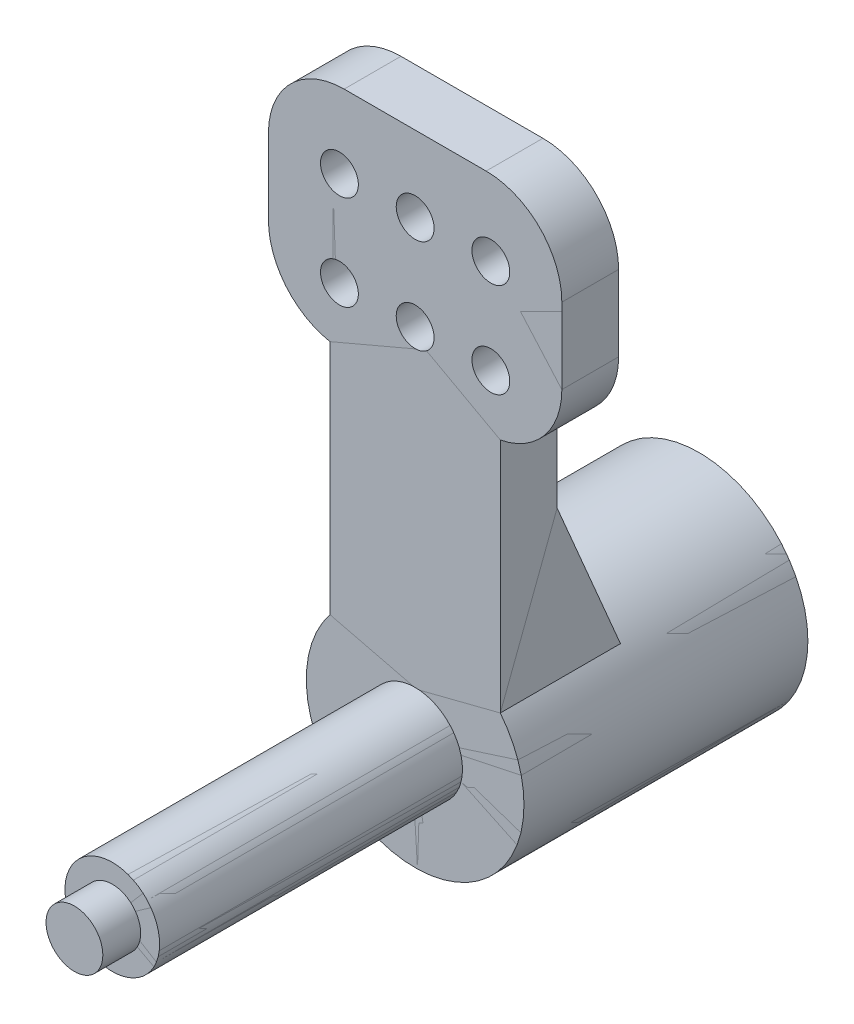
ISO-10303-21;
HEADER;
FILE_DESCRIPTION(('STEP AP214'),'2;1');
FILE_NAME('part.step','',(''),(''),'','','');
FILE_SCHEMA(('AUTOMOTIVE_DESIGN { 1 0 10303 214 1 1 1 1 }'));
ENDSEC;
DATA;
#1=APPLICATION_CONTEXT('core data for automotive mechanical design processes');
#2=APPLICATION_PROTOCOL_DEFINITION('international standard','automotive_design',2000,#1);
#3=PRODUCT_CONTEXT('',#1,'mechanical');
#4=PRODUCT('Part','Part','',(#3));
#5=PRODUCT_RELATED_PRODUCT_CATEGORY('part','',(#4));
#6=PRODUCT_DEFINITION_FORMATION('','',#4);
#7=PRODUCT_DEFINITION_CONTEXT('part definition',#1,'design');
#8=PRODUCT_DEFINITION('design','',#6,#7);
#9=PRODUCT_DEFINITION_SHAPE('','',#8);
#10=(LENGTH_UNIT() NAMED_UNIT(*) SI_UNIT(.MILLI.,.METRE.));
#11=(NAMED_UNIT(*) PLANE_ANGLE_UNIT() SI_UNIT($,.RADIAN.));
#12=(NAMED_UNIT(*) SI_UNIT($,.STERADIAN.) SOLID_ANGLE_UNIT());
#13=UNCERTAINTY_MEASURE_WITH_UNIT(LENGTH_MEASURE(1.E-05),#10,'distance_accuracy_value','');
#14=(GEOMETRIC_REPRESENTATION_CONTEXT(3) GLOBAL_UNCERTAINTY_ASSIGNED_CONTEXT((#13)) GLOBAL_UNIT_ASSIGNED_CONTEXT((#10,
#11,#12)) REPRESENTATION_CONTEXT('',''));
#15=CARTESIAN_POINT('',(0.,0.,0.));
#16=DIRECTION('',(0.,0.,1.));
#17=DIRECTION('',(1.,0.,0.));
#18=AXIS2_PLACEMENT_3D('',#15,#16,#17);
#19=CARTESIAN_POINT('',(1.4012541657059,-1.4012541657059,-17.));
#20=DIRECTION('',(0.,0.,-1.));
#21=DIRECTION('',(-1.,0.,0.));
#22=AXIS2_PLACEMENT_3D('',#19,#20,#21);
#23=PLANE('',#22);
#24=CARTESIAN_POINT('',(0.,0.,-17.));
#25=DIRECTION('',(0.,0.,-1.));
#26=DIRECTION('',(-1.,0.,0.));
#27=AXIS2_PLACEMENT_3D('',#24,#25,#26);
#28=CIRCLE('',#27,0.999999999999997);
#29=CARTESIAN_POINT('',(-0.999999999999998,0.,-17.));
#30=VERTEX_POINT('',#29);
#31=EDGE_CURVE('P0_E639',#30,#30,#28,.T.);
#32=ORIENTED_EDGE('',*,*,#31,.T.);
#33=EDGE_LOOP('',(#32));
#34=FACE_BOUND('',#33,.T.);
#35=ADVANCED_FACE('P0_F350',(#34),#23,.T.);
#36=CARTESIAN_POINT('',(-1.5,-1.5,18.));
#37=DIRECTION('',(0.,0.,1.));
#38=DIRECTION('',(1.,0.,0.));
#39=AXIS2_PLACEMENT_3D('',#36,#37,#38);
#40=PLANE('',#39);
#41=CARTESIAN_POINT('',(0.,0.,18.));
#42=DIRECTION('',(0.,0.,1.));
#43=DIRECTION('',(1.,0.,0.));
#44=AXIS2_PLACEMENT_3D('',#41,#42,#43);
#45=CIRCLE('',#44,1.5);
#46=CARTESIAN_POINT('',(1.5,0.,18.));
#47=VERTEX_POINT('',#46);
#48=EDGE_CURVE('P0_E494',#47,#47,#45,.T.);
#49=ORIENTED_EDGE('',*,*,#48,.T.);
#50=EDGE_LOOP('',(#49));
#51=FACE_BOUND('',#50,.T.);
#52=ADVANCED_FACE('P0_F648',(#51),#40,.T.);
#53=CARTESIAN_POINT('',(0.,0.,-15.));
#54=DIRECTION('',(0.,0.,-1.));
#55=DIRECTION('',(-1.,0.,0.));
#56=AXIS2_PLACEMENT_3D('',#53,#54,#55);
#57=CYLINDRICAL_SURFACE('',#56,0.999999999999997);
#58=CARTESIAN_POINT('',(0.,0.,-15.));
#59=DIRECTION('',(0.,0.,-1.));
#60=DIRECTION('',(-1.,0.,0.));
#61=AXIS2_PLACEMENT_3D('',#58,#59,#60);
#62=CIRCLE('',#61,0.999999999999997);
#63=CARTESIAN_POINT('',(-0.999999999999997,0.,-15.));
#64=VERTEX_POINT('',#63);
#65=EDGE_CURVE('P0_E469',#64,#64,#62,.F.);
#66=ORIENTED_EDGE('',*,*,#65,.F.);
#67=EDGE_LOOP('',(#66));
#68=FACE_BOUND('',#67,.T.);
#69=ORIENTED_EDGE('',*,*,#31,.F.);
#70=EDGE_LOOP('',(#69));
#71=FACE_BOUND('',#70,.T.);
#72=ADVANCED_FACE('P0_F645',(#68,#71),#57,.T.);
#73=CARTESIAN_POINT('',(0.,0.,16.));
#74=DIRECTION('',(0.,0.,1.));
#75=DIRECTION('',(1.,0.,0.));
#76=AXIS2_PLACEMENT_3D('',#73,#74,#75);
#77=CYLINDRICAL_SURFACE('',#76,1.5);
#78=CARTESIAN_POINT('',(0.,0.,16.));
#79=DIRECTION('',(0.,0.,1.));
#80=DIRECTION('',(1.,0.,0.));
#81=AXIS2_PLACEMENT_3D('',#78,#79,#80);
#82=CIRCLE('',#81,1.5);
#83=CARTESIAN_POINT('',(1.5,0.,16.));
#84=VERTEX_POINT('',#83);
#85=EDGE_CURVE('P0_E507',#84,#84,#82,.F.);
#86=ORIENTED_EDGE('',*,*,#85,.F.);
#87=EDGE_LOOP('',(#86));
#88=FACE_BOUND('',#87,.T.);
#89=ORIENTED_EDGE('',*,*,#48,.F.);
#90=EDGE_LOOP('',(#89));
#91=FACE_BOUND('',#90,.T.);
#92=ADVANCED_FACE('P0_F647',(#88,#91),#77,.T.);
#93=CARTESIAN_POINT('',(-2.5,11.4565476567,-5.6679621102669));
#94=DIRECTION('',(1.,0.,0.));
#95=DIRECTION('',(0.,0.,1.));
#96=AXIS2_PLACEMENT_3D('',#93,#94,#95);
#97=PLANE('',#96);
#98=DIRECTION('',(0.,1.,0.));
#99=VECTOR('',#98,1.);
#100=CARTESIAN_POINT('',(-2.50000000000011,16.589039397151,-3.));
#101=LINE('',#100,#99);
#102=CARTESIAN_POINT('',(-2.50000000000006,5.17807879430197,-3.));
#103=VERTEX_POINT('',#102);
#104=CARTESIAN_POINT('',(-2.50000000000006,11.4565476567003,-3.));
#105=VERTEX_POINT('',#104);
#106=EDGE_CURVE('P0_E477',#103,#105,#101,.T.);
#107=ORIENTED_EDGE('',*,*,#106,.F.);
#108=DIRECTION('',(0.,0.,-1.));
#109=VECTOR('',#108,1.);
#110=CARTESIAN_POINT('',(-2.50000000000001,5.17807879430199,-7.5));
#111=LINE('',#110,#109);
#112=CARTESIAN_POINT('',(-2.49999999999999,5.178078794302,-5.66796211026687));
#113=VERTEX_POINT('',#112);
#114=EDGE_CURVE('P0_E497',#103,#113,#111,.T.);
#115=ORIENTED_EDGE('',*,*,#114,.T.);
#116=DIRECTION('',(0.,-0.920351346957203,-0.391092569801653));
#117=VECTOR('',#116,1.);
#118=CARTESIAN_POINT('',(-2.49999999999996,7.51800146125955,-4.67363926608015));
#119=LINE('',#118,#117);
#120=EDGE_CURVE('P0_E453',#105,#113,#119,.T.);
#121=ORIENTED_EDGE('',*,*,#120,.F.);
#122=EDGE_LOOP('',(#107,#115,#121));
#123=FACE_BOUND('',#122,.T.);
#124=ADVANCED_FACE('P0_F655',(#123),#97,.T.);
#125=CARTESIAN_POINT('',(-4.5,11.4565476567,-3.));
#126=DIRECTION('',(0.,0.391092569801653,-0.920351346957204));
#127=DIRECTION('',(1.,0.,0.));
#128=AXIS2_PLACEMENT_3D('',#125,#126,#127);
#129=PLANE('',#128);
#130=ORIENTED_EDGE('',*,*,#120,.T.);
#131=CARTESIAN_POINT('',(0.,0.,-7.86832629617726));
#132=DIRECTION('',(0.,0.391092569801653,-0.920351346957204));
#133=DIRECTION('',(0.,0.920351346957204,0.391092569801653));
#134=AXIS2_PLACEMENT_3D('',#131,#132,#133);
#135=ELLIPSE('',#134,6.24761404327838,5.75);
#136=CARTESIAN_POINT('',(-4.49999999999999,3.5794552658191,-6.34727853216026));
#137=VERTEX_POINT('',#136);
#138=EDGE_CURVE('P0_E499',#113,#137,#135,.F.);
#139=ORIENTED_EDGE('',*,*,#138,.T.);
#140=DIRECTION('',(0.,-0.92035134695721,-0.391092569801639));
#141=VECTOR('',#140,1.);
#142=CARTESIAN_POINT('',(-4.5,11.4565476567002,-2.99999999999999));
#143=LINE('',#142,#141);
#144=CARTESIAN_POINT('',(-4.5,11.4565476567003,-3.));
#145=VERTEX_POINT('',#144);
#146=EDGE_CURVE('P0_E500',#145,#137,#143,.T.);
#147=ORIENTED_EDGE('',*,*,#146,.F.);
#148=DIRECTION('',(-1.,0.,0.));
#149=VECTOR('',#148,1.);
#150=CARTESIAN_POINT('',(-3.66096060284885,11.4565476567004,-3.));
#151=LINE('',#150,#149);
#152=EDGE_CURVE('P0_E505',#105,#145,#151,.T.);
#153=ORIENTED_EDGE('',*,*,#152,.F.);
#154=EDGE_LOOP('',(#130,#139,#147,#153));
#155=FACE_BOUND('',#154,.T.);
#156=ADVANCED_FACE('P0_F740',(#155),#129,.T.);
#157=CARTESIAN_POINT('',(2.5,5.178078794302,-5.6679621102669));
#158=DIRECTION('',(-1.,0.,0.));
#159=DIRECTION('',(0.,0.,1.));
#160=AXIS2_PLACEMENT_3D('',#157,#158,#159);
#161=PLANE('',#160);
#162=DIRECTION('',(0.,0.,1.));
#163=VECTOR('',#162,1.);
#164=CARTESIAN_POINT('',(2.50000000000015,5.17807879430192,-7.5));
#165=LINE('',#164,#163);
#166=CARTESIAN_POINT('',(2.50000000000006,5.17807879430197,-5.66796211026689));
#167=VERTEX_POINT('',#166);
#168=CARTESIAN_POINT('',(2.50000000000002,5.17807879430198,-3.));
#169=VERTEX_POINT('',#168);
#170=EDGE_CURVE('P0_E474',#167,#169,#165,.T.);
#171=ORIENTED_EDGE('',*,*,#170,.T.);
#172=DIRECTION('',(0.,-1.,0.));
#173=VECTOR('',#172,1.);
#174=CARTESIAN_POINT('',(2.49999999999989,16.589039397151,-3.));
#175=LINE('',#174,#173);
#176=CARTESIAN_POINT('',(2.49999999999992,11.4565476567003,-3.));
#177=VERTEX_POINT('',#176);
#178=EDGE_CURVE('P0_E472',#177,#169,#175,.T.);
#179=ORIENTED_EDGE('',*,*,#178,.F.);
#180=DIRECTION('',(0.,0.920351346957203,0.391092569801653));
#181=VECTOR('',#180,1.);
#182=CARTESIAN_POINT('',(2.49999999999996,7.51800146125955,-4.67363926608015));
#183=LINE('',#182,#181);
#184=EDGE_CURVE('P0_E459',#167,#177,#183,.T.);
#185=ORIENTED_EDGE('',*,*,#184,.F.);
#186=EDGE_LOOP('',(#171,#179,#185));
#187=FACE_BOUND('',#186,.T.);
#188=ADVANCED_FACE('P0_F473',(#187),#161,.T.);
#189=CARTESIAN_POINT('',(5.75,-5.75,-15.));
#190=DIRECTION('',(0.,0.,-1.));
#191=DIRECTION('',(-1.,0.,0.));
#192=AXIS2_PLACEMENT_3D('',#189,#190,#191);
#193=PLANE('',#192);
#194=ORIENTED_EDGE('',*,*,#65,.T.);
#195=EDGE_LOOP('',(#194));
#196=FACE_BOUND('',#195,.T.);
#197=CARTESIAN_POINT('',(0.,0.,-15.));
#198=DIRECTION('',(0.,0.,1.));
#199=DIRECTION('',(1.,0.,0.));
#200=AXIS2_PLACEMENT_3D('',#197,#198,#199);
#201=CIRCLE('',#200,5.75);
#202=CARTESIAN_POINT('',(5.75,0.,-15.));
#203=VERTEX_POINT('',#202);
#204=EDGE_CURVE('P0_E613',#203,#203,#201,.F.);
#205=ORIENTED_EDGE('',*,*,#204,.T.);
#206=EDGE_LOOP('',(#205));
#207=FACE_BOUND('',#206,.T.);
#208=ADVANCED_FACE('P0_F801',(#196,#207),#193,.T.);
#209=CARTESIAN_POINT('',(4.5,3.5794552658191,-6.3472785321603));
#210=DIRECTION('',(0.,0.391092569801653,-0.920351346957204));
#211=DIRECTION('',(-1.,0.,0.));
#212=AXIS2_PLACEMENT_3D('',#209,#210,#211);
#213=PLANE('',#212);
#214=ORIENTED_EDGE('',*,*,#184,.T.);
#215=DIRECTION('',(-1.,0.,0.));
#216=VECTOR('',#215,1.);
#217=CARTESIAN_POINT('',(-3.66096060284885,11.4565476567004,-3.));
#218=LINE('',#217,#216);
#219=CARTESIAN_POINT('',(4.5,11.4565476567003,-3.));
#220=VERTEX_POINT('',#219);
#221=EDGE_CURVE('P0_E464',#220,#177,#218,.T.);
#222=ORIENTED_EDGE('',*,*,#221,.F.);
#223=DIRECTION('',(0.,0.92035134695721,0.391092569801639));
#224=VECTOR('',#223,1.);
#225=CARTESIAN_POINT('',(4.5,3.5794552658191,-6.34727853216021));
#226=LINE('',#225,#224);
#227=CARTESIAN_POINT('',(4.5,3.5794552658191,-6.34727853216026));
#228=VERTEX_POINT('',#227);
#229=EDGE_CURVE('P0_E610',#228,#220,#226,.T.);
#230=ORIENTED_EDGE('',*,*,#229,.F.);
#231=CARTESIAN_POINT('',(0.,0.,-7.86832629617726));
#232=DIRECTION('',(0.,0.391092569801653,-0.920351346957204));
#233=DIRECTION('',(0.,0.920351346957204,0.391092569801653));
#234=AXIS2_PLACEMENT_3D('',#231,#232,#233);
#235=ELLIPSE('',#234,6.24761404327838,5.75);
#236=EDGE_CURVE('P0_E466',#228,#167,#235,.F.);
#237=ORIENTED_EDGE('',*,*,#236,.T.);
#238=EDGE_LOOP('',(#214,#222,#230,#237));
#239=FACE_BOUND('',#238,.T.);
#240=ADVANCED_FACE('P0_F461',(#239),#213,.T.);
#241=CARTESIAN_POINT('',(7.7500000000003,5.178078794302,-3.));
#242=DIRECTION('',(0.,0.,-1.));
#243=DIRECTION('',(-1.,0.,0.));
#244=AXIS2_PLACEMENT_3D('',#241,#242,#243);
#245=PLANE('',#244);
#246=CARTESIAN_POINT('',(4.,19.,-3.));
#247=DIRECTION('',(0.,0.,-1.));
#248=DIRECTION('',(-1.,0.,0.));
#249=AXIS2_PLACEMENT_3D('',#246,#247,#248);
#250=CIRCLE('',#249,1.);
#251=CARTESIAN_POINT('',(3.,19.,-3.));
#252=VERTEX_POINT('',#251);
#253=EDGE_CURVE('P0_E574',#252,#252,#250,.T.);
#254=ORIENTED_EDGE('',*,*,#253,.F.);
#255=EDGE_LOOP('',(#254));
#256=FACE_BOUND('',#255,.T.);
#257=CARTESIAN_POINT('',(0.,19.,-3.));
#258=DIRECTION('',(0.,0.,-1.));
#259=DIRECTION('',(-1.,0.,0.));
#260=AXIS2_PLACEMENT_3D('',#257,#258,#259);
#261=CIRCLE('',#260,1.);
#262=CARTESIAN_POINT('',(-1.,19.,-3.));
#263=VERTEX_POINT('',#262);
#264=EDGE_CURVE('P0_E579',#263,#263,#261,.T.);
#265=ORIENTED_EDGE('',*,*,#264,.F.);
#266=EDGE_LOOP('',(#265));
#267=FACE_BOUND('',#266,.T.);
#268=CARTESIAN_POINT('',(-4.,19.,-3.));
#269=DIRECTION('',(0.,0.,-1.));
#270=DIRECTION('',(-1.,0.,0.));
#271=AXIS2_PLACEMENT_3D('',#268,#269,#270);
#272=CIRCLE('',#271,1.);
#273=CARTESIAN_POINT('',(-5.,19.,-3.));
#274=VERTEX_POINT('',#273);
#275=EDGE_CURVE('P0_E584',#274,#274,#272,.T.);
#276=ORIENTED_EDGE('',*,*,#275,.F.);
#277=EDGE_LOOP('',(#276));
#278=FACE_BOUND('',#277,.T.);
#279=CARTESIAN_POINT('',(0.,24.,-3.));
#280=DIRECTION('',(0.,0.,-1.));
#281=DIRECTION('',(-1.,0.,0.));
#282=AXIS2_PLACEMENT_3D('',#279,#280,#281);
#283=CIRCLE('',#282,1.);
#284=CARTESIAN_POINT('',(-1.,24.,-3.));
#285=VERTEX_POINT('',#284);
#286=EDGE_CURVE('P0_E589',#285,#285,#283,.T.);
#287=ORIENTED_EDGE('',*,*,#286,.F.);
#288=EDGE_LOOP('',(#287));
#289=FACE_BOUND('',#288,.T.);
#290=CARTESIAN_POINT('',(-4.,24.,-3.));
#291=DIRECTION('',(0.,0.,-1.));
#292=DIRECTION('',(-1.,0.,0.));
#293=AXIS2_PLACEMENT_3D('',#290,#291,#292);
#294=CIRCLE('',#293,1.);
#295=CARTESIAN_POINT('',(-5.,24.,-3.));
#296=VERTEX_POINT('',#295);
#297=EDGE_CURVE('P0_E594',#296,#296,#294,.T.);
#298=ORIENTED_EDGE('',*,*,#297,.F.);
#299=EDGE_LOOP('',(#298));
#300=FACE_BOUND('',#299,.T.);
#301=CARTESIAN_POINT('',(4.,24.,-3.));
#302=DIRECTION('',(0.,0.,-1.));
#303=DIRECTION('',(-1.,0.,0.));
#304=AXIS2_PLACEMENT_3D('',#301,#302,#303);
#305=CIRCLE('',#304,1.);
#306=CARTESIAN_POINT('',(3.,24.,-3.));
#307=VERTEX_POINT('',#306);
#308=EDGE_CURVE('P0_E599',#307,#307,#305,.T.);
#309=ORIENTED_EDGE('',*,*,#308,.F.);
#310=EDGE_LOOP('',(#309));
#311=FACE_BOUND('',#310,.T.);
#312=DIRECTION('',(-1.,0.,0.));
#313=VECTOR('',#312,1.);
#314=CARTESIAN_POINT('',(0.,28.,-3.));
#315=LINE('',#314,#313);
#316=CARTESIAN_POINT('',(3.75,28.,-3.));
#317=VERTEX_POINT('',#316);
#318=CARTESIAN_POINT('',(-3.74999999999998,27.9999999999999,-3.));
#319=VERTEX_POINT('',#318);
#320=EDGE_CURVE('P0_E515',#317,#319,#315,.T.);
#321=ORIENTED_EDGE('',*,*,#320,.F.);
#322=CARTESIAN_POINT('',(3.75,24.,-3.));
#323=DIRECTION('',(0.,0.,1.));
#324=DIRECTION('',(1.,0.,0.));
#325=AXIS2_PLACEMENT_3D('',#322,#323,#324);
#326=CIRCLE('',#325,3.99999999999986);
#327=CARTESIAN_POINT('',(7.75,24.,-3.));
#328=VERTEX_POINT('',#327);
#329=EDGE_CURVE('P0_E445',#317,#328,#326,.F.);
#330=ORIENTED_EDGE('',*,*,#329,.T.);
#331=DIRECTION('',(0.,1.,0.));
#332=VECTOR('',#331,1.);
#333=CARTESIAN_POINT('',(7.75,22.,-3.));
#334=LINE('',#333,#332);
#335=CARTESIAN_POINT('',(7.75,20.,-3.));
#336=VERTEX_POINT('',#335);
#337=EDGE_CURVE('P0_E692',#336,#328,#334,.T.);
#338=ORIENTED_EDGE('',*,*,#337,.F.);
#339=CARTESIAN_POINT('',(3.75,20.,-3.));
#340=DIRECTION('',(0.,0.,1.));
#341=DIRECTION('',(1.,0.,0.));
#342=AXIS2_PLACEMENT_3D('',#339,#340,#341);
#343=CIRCLE('',#342,4.00000000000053);
#344=CARTESIAN_POINT('',(4.49999999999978,16.070941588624,-3.));
#345=VERTEX_POINT('',#344);
#346=EDGE_CURVE('P0_E607',#336,#345,#343,.F.);
#347=ORIENTED_EDGE('',*,*,#346,.T.);
#348=DIRECTION('',(0.,1.,0.));
#349=VECTOR('',#348,1.);
#350=CARTESIAN_POINT('',(4.5,9.82519842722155,-2.99999999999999));
#351=LINE('',#350,#349);
#352=EDGE_CURVE('P0_E481',#220,#345,#351,.T.);
#353=ORIENTED_EDGE('',*,*,#352,.F.);
#354=ORIENTED_EDGE('',*,*,#221,.T.);
#355=ORIENTED_EDGE('',*,*,#178,.T.);
#356=CARTESIAN_POINT('',(0.,0.,-3.));
#357=DIRECTION('',(0.,0.,1.));
#358=DIRECTION('',(1.,0.,0.));
#359=AXIS2_PLACEMENT_3D('',#356,#357,#358);
#360=CIRCLE('',#359,5.75);
#361=EDGE_CURVE('P0_E489',#169,#103,#360,.T.);
#362=ORIENTED_EDGE('',*,*,#361,.T.);
#363=ORIENTED_EDGE('',*,*,#106,.T.);
#364=ORIENTED_EDGE('',*,*,#152,.T.);
#365=DIRECTION('',(0.,-1.,0.));
#366=VECTOR('',#365,1.);
#367=CARTESIAN_POINT('',(-4.5,9.82519842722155,-2.99999999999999));
#368=LINE('',#367,#366);
#369=CARTESIAN_POINT('',(-4.5,16.0709415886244,-3.));
#370=VERTEX_POINT('',#369);
#371=EDGE_CURVE('P0_E501',#370,#145,#368,.T.);
#372=ORIENTED_EDGE('',*,*,#371,.F.);
#373=CARTESIAN_POINT('',(-3.75,20.,-3.));
#374=DIRECTION('',(0.,0.,1.));
#375=DIRECTION('',(1.,0.,0.));
#376=AXIS2_PLACEMENT_3D('',#373,#374,#375);
#377=CIRCLE('',#376,3.99999999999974);
#378=CARTESIAN_POINT('',(-7.74999999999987,20.0000000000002,-3.));
#379=VERTEX_POINT('',#378);
#380=EDGE_CURVE('P0_E513',#370,#379,#377,.F.);
#381=ORIENTED_EDGE('',*,*,#380,.T.);
#382=DIRECTION('',(0.,-1.,0.));
#383=VECTOR('',#382,1.);
#384=CARTESIAN_POINT('',(-7.75,22.,-3.));
#385=LINE('',#384,#383);
#386=CARTESIAN_POINT('',(-7.75,24.,-3.));
#387=VERTEX_POINT('',#386);
#388=EDGE_CURVE('P0_E510',#387,#379,#385,.T.);
#389=ORIENTED_EDGE('',*,*,#388,.F.);
#390=CARTESIAN_POINT('',(-3.75,24.,-3.));
#391=DIRECTION('',(0.,0.,1.));
#392=DIRECTION('',(1.,0.,0.));
#393=AXIS2_PLACEMENT_3D('',#390,#391,#392);
#394=CIRCLE('',#393,3.99999999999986);
#395=EDGE_CURVE('P0_E517',#387,#319,#394,.F.);
#396=ORIENTED_EDGE('',*,*,#395,.T.);
#397=EDGE_LOOP('',(#321,#330,#338,#347,#353,#354,#355,#362,#363,#364,#372,#381,#389,#396));
#398=FACE_BOUND('',#397,.T.);
#399=ADVANCED_FACE('P0_F479',(#256,#267,#278,#289,#300,#311,#398),#245,.T.);
#400=CARTESIAN_POINT('',(-2.5,-2.5,16.));
#401=DIRECTION('',(0.,0.,1.));
#402=DIRECTION('',(1.,0.,0.));
#403=AXIS2_PLACEMENT_3D('',#400,#401,#402);
#404=PLANE('',#403);
#405=ORIENTED_EDGE('',*,*,#85,.T.);
#406=EDGE_LOOP('',(#405));
#407=FACE_BOUND('',#406,.T.);
#408=CARTESIAN_POINT('',(0.,0.,16.));
#409=DIRECTION('',(0.,0.,1.));
#410=DIRECTION('',(1.,0.,0.));
#411=AXIS2_PLACEMENT_3D('',#408,#409,#410);
#412=CIRCLE('',#411,2.5);
#413=CARTESIAN_POINT('',(2.5,0.,16.));
#414=VERTEX_POINT('',#413);
#415=EDGE_CURVE('P0_E571',#414,#414,#412,.T.);
#416=ORIENTED_EDGE('',*,*,#415,.T.);
#417=EDGE_LOOP('',(#416));
#418=FACE_BOUND('',#417,.T.);
#419=ADVANCED_FACE('P0_F809',(#407,#418),#404,.T.);
#420=CARTESIAN_POINT('',(3.75,24.,-3.));
#421=DIRECTION('',(0.,0.,1.));
#422=DIRECTION('',(1.,0.,0.));
#423=AXIS2_PLACEMENT_3D('',#420,#421,#422);
#424=CYLINDRICAL_SURFACE('',#423,3.99999999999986);
#425=DIRECTION('',(0.,0.,1.));
#426=VECTOR('',#425,1.);
#427=CARTESIAN_POINT('',(7.75,24.,-2.));
#428=LINE('',#427,#426);
#429=CARTESIAN_POINT('',(7.75000000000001,24.,0.));
#430=VERTEX_POINT('',#429);
#431=EDGE_CURVE('P0_E604',#328,#430,#428,.T.);
#432=ORIENTED_EDGE('',*,*,#431,.F.);
#433=ORIENTED_EDGE('',*,*,#329,.F.);
#434=DIRECTION('',(0.,0.,-1.));
#435=VECTOR('',#434,1.);
#436=CARTESIAN_POINT('',(3.75,28.,-3.75));
#437=LINE('',#436,#435);
#438=CARTESIAN_POINT('',(3.75,28.,0.));
#439=VERTEX_POINT('',#438);
#440=EDGE_CURVE('P0_E518',#439,#317,#437,.T.);
#441=ORIENTED_EDGE('',*,*,#440,.F.);
#442=CARTESIAN_POINT('',(3.75,24.,0.));
#443=DIRECTION('',(0.,0.,1.));
#444=DIRECTION('',(1.,0.,0.));
#445=AXIS2_PLACEMENT_3D('',#442,#443,#444);
#446=CIRCLE('',#445,3.99999999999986);
#447=EDGE_CURVE('P0_E568',#430,#439,#446,.T.);
#448=ORIENTED_EDGE('',*,*,#447,.F.);
#449=EDGE_LOOP('',(#432,#433,#441,#448));
#450=FACE_BOUND('',#449,.T.);
#451=ADVANCED_FACE('P0_F710',(#450),#424,.T.);
#452=CARTESIAN_POINT('',(3.75,28.,0.));
#453=DIRECTION('',(0.,1.,0.));
#454=DIRECTION('',(0.,0.,-1.));
#455=AXIS2_PLACEMENT_3D('',#452,#453,#454);
#456=PLANE('',#455);
#457=ORIENTED_EDGE('',*,*,#320,.T.);
#458=DIRECTION('',(0.,0.,1.));
#459=VECTOR('',#458,1.);
#460=CARTESIAN_POINT('',(-3.74999999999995,27.9999999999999,-1.5));
#461=LINE('',#460,#459);
#462=CARTESIAN_POINT('',(-3.74999999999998,27.9999999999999,0.));
#463=VERTEX_POINT('',#462);
#464=EDGE_CURVE('P0_E627',#319,#463,#461,.T.);
#465=ORIENTED_EDGE('',*,*,#464,.T.);
#466=DIRECTION('',(-1.,0.,0.));
#467=VECTOR('',#466,1.);
#468=CARTESIAN_POINT('',(8.95625,28.,0.));
#469=LINE('',#468,#467);
#470=EDGE_CURVE('P0_E567',#439,#463,#469,.T.);
#471=ORIENTED_EDGE('',*,*,#470,.F.);
#472=ORIENTED_EDGE('',*,*,#440,.T.);
#473=EDGE_LOOP('',(#457,#465,#471,#472));
#474=FACE_BOUND('',#473,.T.);
#475=ADVANCED_FACE('P0_F715',(#474),#456,.T.);
#476=CARTESIAN_POINT('',(-3.75,24.,-3.));
#477=DIRECTION('',(0.,0.,1.));
#478=DIRECTION('',(1.,0.,0.));
#479=AXIS2_PLACEMENT_3D('',#476,#477,#478);
#480=CYLINDRICAL_SURFACE('',#479,3.99999999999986);
#481=ORIENTED_EDGE('',*,*,#464,.F.);
#482=ORIENTED_EDGE('',*,*,#395,.F.);
#483=DIRECTION('',(0.,0.,-1.));
#484=VECTOR('',#483,1.);
#485=CARTESIAN_POINT('',(-7.75,24.,-2.));
#486=LINE('',#485,#484);
#487=CARTESIAN_POINT('',(-7.75,24.,0.));
#488=VERTEX_POINT('',#487);
#489=EDGE_CURVE('P0_E514',#488,#387,#486,.T.);
#490=ORIENTED_EDGE('',*,*,#489,.F.);
#491=CARTESIAN_POINT('',(-3.75,24.,0.));
#492=DIRECTION('',(0.,0.,1.));
#493=DIRECTION('',(1.,0.,0.));
#494=AXIS2_PLACEMENT_3D('',#491,#492,#493);
#495=CIRCLE('',#494,3.99999999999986);
#496=EDGE_CURVE('P0_E564',#463,#488,#495,.T.);
#497=ORIENTED_EDGE('',*,*,#496,.F.);
#498=EDGE_LOOP('',(#481,#482,#490,#497));
#499=FACE_BOUND('',#498,.T.);
#500=ADVANCED_FACE('P0_F752',(#499),#480,.T.);
#501=CARTESIAN_POINT('',(-7.75,24.,0.));
#502=DIRECTION('',(-1.,0.,0.));
#503=DIRECTION('',(0.,0.,-1.));
#504=AXIS2_PLACEMENT_3D('',#501,#502,#503);
#505=PLANE('',#504);
#506=ORIENTED_EDGE('',*,*,#388,.T.);
#507=DIRECTION('',(0.,0.,1.));
#508=VECTOR('',#507,1.);
#509=CARTESIAN_POINT('',(-7.74999999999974,20.0000000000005,-1.5));
#510=LINE('',#509,#508);
#511=CARTESIAN_POINT('',(-7.74999999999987,20.0000000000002,0.));
#512=VERTEX_POINT('',#511);
#513=EDGE_CURVE('P0_E625',#379,#512,#510,.T.);
#514=ORIENTED_EDGE('',*,*,#513,.T.);
#515=DIRECTION('',(0.,-1.,0.));
#516=VECTOR('',#515,1.);
#517=CARTESIAN_POINT('',(-7.75,10.0795525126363,0.));
#518=LINE('',#517,#516);
#519=EDGE_CURVE('P0_E563',#488,#512,#518,.T.);
#520=ORIENTED_EDGE('',*,*,#519,.F.);
#521=ORIENTED_EDGE('',*,*,#489,.T.);
#522=EDGE_LOOP('',(#506,#514,#520,#521));
#523=FACE_BOUND('',#522,.T.);
#524=ADVANCED_FACE('P0_F747',(#523),#505,.T.);
#525=CARTESIAN_POINT('',(-3.75,20.,-3.));
#526=DIRECTION('',(0.,0.,1.));
#527=DIRECTION('',(1.,0.,0.));
#528=AXIS2_PLACEMENT_3D('',#525,#526,#527);
#529=CYLINDRICAL_SURFACE('',#528,3.99999999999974);
#530=ORIENTED_EDGE('',*,*,#513,.F.);
#531=ORIENTED_EDGE('',*,*,#380,.F.);
#532=DIRECTION('',(0.,0.,-1.));
#533=VECTOR('',#532,1.);
#534=CARTESIAN_POINT('',(-4.5,16.070941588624,-6.2457431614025));
#535=LINE('',#534,#533);
#536=CARTESIAN_POINT('',(-4.5,16.0709415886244,0.));
#537=VERTEX_POINT('',#536);
#538=EDGE_CURVE('P0_E504',#537,#370,#535,.T.);
#539=ORIENTED_EDGE('',*,*,#538,.F.);
#540=CARTESIAN_POINT('',(-3.75,20.,0.));
#541=DIRECTION('',(0.,0.,1.));
#542=DIRECTION('',(1.,0.,0.));
#543=AXIS2_PLACEMENT_3D('',#540,#541,#542);
#544=CIRCLE('',#543,3.99999999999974);
#545=EDGE_CURVE('P0_E560',#512,#537,#544,.T.);
#546=ORIENTED_EDGE('',*,*,#545,.F.);
#547=EDGE_LOOP('',(#530,#531,#539,#546));
#548=FACE_BOUND('',#547,.T.);
#549=ADVANCED_FACE('P0_F750',(#548),#529,.T.);
#550=CARTESIAN_POINT('',(-4.5,16.070941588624,0.));
#551=DIRECTION('',(-1.,0.,0.));
#552=DIRECTION('',(0.,0.,-1.));
#553=AXIS2_PLACEMENT_3D('',#550,#551,#552);
#554=PLANE('',#553);
#555=ORIENTED_EDGE('',*,*,#146,.T.);
#556=DIRECTION('',(0.,0.,1.));
#557=VECTOR('',#556,1.);
#558=CARTESIAN_POINT('',(-4.49999999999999,3.5794552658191,-7.5));
#559=LINE('',#558,#557);
#560=CARTESIAN_POINT('',(-4.5,3.57945526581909,0.));
#561=VERTEX_POINT('',#560);
#562=EDGE_CURVE('P0_E620',#137,#561,#559,.T.);
#563=ORIENTED_EDGE('',*,*,#562,.T.);
#564=DIRECTION('',(0.,-1.,0.));
#565=VECTOR('',#564,1.);
#566=CARTESIAN_POINT('',(-4.50000000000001,10.0795525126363,0.));
#567=LINE('',#566,#565);
#568=EDGE_CURVE('P0_E559',#537,#561,#567,.T.);
#569=ORIENTED_EDGE('',*,*,#568,.F.);
#570=ORIENTED_EDGE('',*,*,#538,.T.);
#571=ORIENTED_EDGE('',*,*,#371,.T.);
#572=EDGE_LOOP('',(#555,#563,#569,#570,#571));
#573=FACE_BOUND('',#572,.T.);
#574=ADVANCED_FACE('P0_F742',(#573),#554,.T.);
#575=CARTESIAN_POINT('',(0.,0.,-15.));
#576=DIRECTION('',(0.,0.,1.));
#577=DIRECTION('',(1.,0.,0.));
#578=AXIS2_PLACEMENT_3D('',#575,#576,#577);
#579=CYLINDRICAL_SURFACE('',#578,5.75);
#580=ORIENTED_EDGE('',*,*,#114,.F.);
#581=ORIENTED_EDGE('',*,*,#361,.F.);
#582=ORIENTED_EDGE('',*,*,#170,.F.);
#583=ORIENTED_EDGE('',*,*,#236,.F.);
#584=DIRECTION('',(0.,0.,-1.));
#585=VECTOR('',#584,1.);
#586=CARTESIAN_POINT('',(4.5,3.5794552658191,-6.2457431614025));
#587=LINE('',#586,#585);
#588=CARTESIAN_POINT('',(4.49999999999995,3.57945526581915,0.));
#589=VERTEX_POINT('',#588);
#590=EDGE_CURVE('P0_E612',#589,#228,#587,.T.);
#591=ORIENTED_EDGE('',*,*,#590,.F.);
#592=CARTESIAN_POINT('',(0.,0.,0.));
#593=DIRECTION('',(0.,0.,1.));
#594=DIRECTION('',(1.,0.,0.));
#595=AXIS2_PLACEMENT_3D('',#592,#593,#594);
#596=CIRCLE('',#595,5.75);
#597=EDGE_CURVE('P0_E556',#561,#589,#596,.T.);
#598=ORIENTED_EDGE('',*,*,#597,.F.);
#599=ORIENTED_EDGE('',*,*,#562,.F.);
#600=ORIENTED_EDGE('',*,*,#138,.F.);
#601=EDGE_LOOP('',(#580,#581,#582,#583,#591,#598,#599,#600));
#602=FACE_BOUND('',#601,.T.);
#603=ORIENTED_EDGE('',*,*,#204,.F.);
#604=EDGE_LOOP('',(#603));
#605=FACE_BOUND('',#604,.T.);
#606=ADVANCED_FACE('P0_F735',(#602,#605),#579,.T.);
#607=CARTESIAN_POINT('',(4.5,3.5794552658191,0.));
#608=DIRECTION('',(1.,0.,0.));
#609=DIRECTION('',(0.,0.,-1.));
#610=AXIS2_PLACEMENT_3D('',#607,#608,#609);
#611=PLANE('',#610);
#612=ORIENTED_EDGE('',*,*,#352,.T.);
#613=DIRECTION('',(0.,0.,1.));
#614=VECTOR('',#613,1.);
#615=CARTESIAN_POINT('',(4.49999999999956,16.070941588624,-1.5));
#616=LINE('',#615,#614);
#617=CARTESIAN_POINT('',(4.49999999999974,16.070941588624,0.));
#618=VERTEX_POINT('',#617);
#619=EDGE_CURVE('P0_E609',#345,#618,#616,.T.);
#620=ORIENTED_EDGE('',*,*,#619,.T.);
#621=DIRECTION('',(0.,1.,0.));
#622=VECTOR('',#621,1.);
#623=CARTESIAN_POINT('',(4.49999999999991,10.0795525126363,0.));
#624=LINE('',#623,#622);
#625=EDGE_CURVE('P0_E555',#589,#618,#624,.T.);
#626=ORIENTED_EDGE('',*,*,#625,.F.);
#627=ORIENTED_EDGE('',*,*,#590,.T.);
#628=ORIENTED_EDGE('',*,*,#229,.T.);
#629=EDGE_LOOP('',(#612,#620,#626,#627,#628));
#630=FACE_BOUND('',#629,.T.);
#631=ADVANCED_FACE('P0_F767',(#630),#611,.T.);
#632=CARTESIAN_POINT('',(3.75,20.,-3.));
#633=DIRECTION('',(0.,0.,1.));
#634=DIRECTION('',(1.,0.,0.));
#635=AXIS2_PLACEMENT_3D('',#632,#633,#634);
#636=CYLINDRICAL_SURFACE('',#635,4.00000000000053);
#637=ORIENTED_EDGE('',*,*,#619,.F.);
#638=ORIENTED_EDGE('',*,*,#346,.F.);
#639=DIRECTION('',(0.,0.,-1.));
#640=VECTOR('',#639,1.);
#641=CARTESIAN_POINT('',(7.75,20.,-2.));
#642=LINE('',#641,#640);
#643=CARTESIAN_POINT('',(7.75000000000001,20.,0.));
#644=VERTEX_POINT('',#643);
#645=EDGE_CURVE('P0_E369',#644,#336,#642,.T.);
#646=ORIENTED_EDGE('',*,*,#645,.F.);
#647=CARTESIAN_POINT('',(3.75,20.,0.));
#648=DIRECTION('',(0.,0.,1.));
#649=DIRECTION('',(1.,0.,0.));
#650=AXIS2_PLACEMENT_3D('',#647,#648,#649);
#651=CIRCLE('',#650,4.00000000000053);
#652=EDGE_CURVE('P0_E552',#618,#644,#651,.T.);
#653=ORIENTED_EDGE('',*,*,#652,.F.);
#654=EDGE_LOOP('',(#637,#638,#646,#653));
#655=FACE_BOUND('',#654,.T.);
#656=ADVANCED_FACE('P0_F688',(#655),#636,.T.);
#657=CARTESIAN_POINT('',(7.75,20.,0.));
#658=DIRECTION('',(1.,0.,0.));
#659=DIRECTION('',(0.,0.,-1.));
#660=AXIS2_PLACEMENT_3D('',#657,#658,#659);
#661=PLANE('',#660);
#662=ORIENTED_EDGE('',*,*,#337,.T.);
#663=ORIENTED_EDGE('',*,*,#431,.T.);
#664=DIRECTION('',(0.,1.,0.));
#665=VECTOR('',#664,1.);
#666=CARTESIAN_POINT('',(7.75000000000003,10.0795525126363,0.));
#667=LINE('',#666,#665);
#668=EDGE_CURVE('P0_E549',#644,#430,#667,.T.);
#669=ORIENTED_EDGE('',*,*,#668,.F.);
#670=ORIENTED_EDGE('',*,*,#645,.T.);
#671=EDGE_LOOP('',(#662,#663,#669,#670));
#672=FACE_BOUND('',#671,.T.);
#673=ADVANCED_FACE('P0_F709',(#672),#661,.T.);
#674=CARTESIAN_POINT('',(4.,24.,0.));
#675=DIRECTION('',(0.,0.,-1.));
#676=DIRECTION('',(-1.,0.,0.));
#677=AXIS2_PLACEMENT_3D('',#674,#675,#676);
#678=CYLINDRICAL_SURFACE('',#677,1.);
#679=ORIENTED_EDGE('',*,*,#308,.T.);
#680=EDGE_LOOP('',(#679));
#681=FACE_BOUND('',#680,.T.);
#682=CARTESIAN_POINT('',(4.,24.,0.));
#683=DIRECTION('',(0.,0.,-1.));
#684=DIRECTION('',(-1.,0.,0.));
#685=AXIS2_PLACEMENT_3D('',#682,#683,#684);
#686=CIRCLE('',#685,1.);
#687=CARTESIAN_POINT('',(3.,24.,0.));
#688=VERTEX_POINT('',#687);
#689=EDGE_CURVE('P0_E544',#688,#688,#686,.T.);
#690=ORIENTED_EDGE('',*,*,#689,.F.);
#691=EDGE_LOOP('',(#690));
#692=FACE_BOUND('',#691,.T.);
#693=ADVANCED_FACE('P0_F770',(#681,#692),#678,.F.);
#694=CARTESIAN_POINT('',(-4.,24.,0.));
#695=DIRECTION('',(0.,0.,-1.));
#696=DIRECTION('',(-1.,0.,0.));
#697=AXIS2_PLACEMENT_3D('',#694,#695,#696);
#698=CYLINDRICAL_SURFACE('',#697,1.);
#699=ORIENTED_EDGE('',*,*,#297,.T.);
#700=EDGE_LOOP('',(#699));
#701=FACE_BOUND('',#700,.T.);
#702=CARTESIAN_POINT('',(-4.,24.,0.));
#703=DIRECTION('',(0.,0.,-1.));
#704=DIRECTION('',(-1.,0.,0.));
#705=AXIS2_PLACEMENT_3D('',#702,#703,#704);
#706=CIRCLE('',#705,1.);
#707=CARTESIAN_POINT('',(-5.,24.,0.));
#708=VERTEX_POINT('',#707);
#709=EDGE_CURVE('P0_E539',#708,#708,#706,.T.);
#710=ORIENTED_EDGE('',*,*,#709,.F.);
#711=EDGE_LOOP('',(#710));
#712=FACE_BOUND('',#711,.T.);
#713=ADVANCED_FACE('P0_F773',(#701,#712),#698,.F.);
#714=CARTESIAN_POINT('',(0.,24.,0.));
#715=DIRECTION('',(0.,0.,-1.));
#716=DIRECTION('',(-1.,0.,0.));
#717=AXIS2_PLACEMENT_3D('',#714,#715,#716);
#718=CYLINDRICAL_SURFACE('',#717,1.);
#719=ORIENTED_EDGE('',*,*,#286,.T.);
#720=EDGE_LOOP('',(#719));
#721=FACE_BOUND('',#720,.T.);
#722=CARTESIAN_POINT('',(0.,24.,0.));
#723=DIRECTION('',(0.,0.,-1.));
#724=DIRECTION('',(-1.,0.,0.));
#725=AXIS2_PLACEMENT_3D('',#722,#723,#724);
#726=CIRCLE('',#725,1.);
#727=CARTESIAN_POINT('',(-1.,24.,0.));
#728=VERTEX_POINT('',#727);
#729=EDGE_CURVE('P0_E534',#728,#728,#726,.T.);
#730=ORIENTED_EDGE('',*,*,#729,.F.);
#731=EDGE_LOOP('',(#730));
#732=FACE_BOUND('',#731,.T.);
#733=ADVANCED_FACE('P0_F777',(#721,#732),#718,.F.);
#734=CARTESIAN_POINT('',(-4.,19.,0.));
#735=DIRECTION('',(0.,0.,-1.));
#736=DIRECTION('',(-1.,0.,0.));
#737=AXIS2_PLACEMENT_3D('',#734,#735,#736);
#738=CYLINDRICAL_SURFACE('',#737,1.);
#739=ORIENTED_EDGE('',*,*,#275,.T.);
#740=EDGE_LOOP('',(#739));
#741=FACE_BOUND('',#740,.T.);
#742=CARTESIAN_POINT('',(-4.,19.,0.));
#743=DIRECTION('',(0.,0.,-1.));
#744=DIRECTION('',(-1.,0.,0.));
#745=AXIS2_PLACEMENT_3D('',#742,#743,#744);
#746=CIRCLE('',#745,1.);
#747=CARTESIAN_POINT('',(-5.,19.,0.));
#748=VERTEX_POINT('',#747);
#749=EDGE_CURVE('P0_E529',#748,#748,#746,.T.);
#750=ORIENTED_EDGE('',*,*,#749,.F.);
#751=EDGE_LOOP('',(#750));
#752=FACE_BOUND('',#751,.T.);
#753=ADVANCED_FACE('P0_F781',(#741,#752),#738,.F.);
#754=CARTESIAN_POINT('',(0.,19.,0.));
#755=DIRECTION('',(0.,0.,-1.));
#756=DIRECTION('',(-1.,0.,0.));
#757=AXIS2_PLACEMENT_3D('',#754,#755,#756);
#758=CYLINDRICAL_SURFACE('',#757,1.);
#759=ORIENTED_EDGE('',*,*,#264,.T.);
#760=EDGE_LOOP('',(#759));
#761=FACE_BOUND('',#760,.T.);
#762=CARTESIAN_POINT('',(0.,19.,0.));
#763=DIRECTION('',(0.,0.,-1.));
#764=DIRECTION('',(-1.,0.,0.));
#765=AXIS2_PLACEMENT_3D('',#762,#763,#764);
#766=CIRCLE('',#765,1.);
#767=CARTESIAN_POINT('',(-1.,19.,0.));
#768=VERTEX_POINT('',#767);
#769=EDGE_CURVE('P0_E524',#768,#768,#766,.T.);
#770=ORIENTED_EDGE('',*,*,#769,.F.);
#771=EDGE_LOOP('',(#770));
#772=FACE_BOUND('',#771,.T.);
#773=ADVANCED_FACE('P0_F785',(#761,#772),#758,.F.);
#774=CARTESIAN_POINT('',(4.,19.,0.));
#775=DIRECTION('',(0.,0.,-1.));
#776=DIRECTION('',(-1.,0.,0.));
#777=AXIS2_PLACEMENT_3D('',#774,#775,#776);
#778=CYLINDRICAL_SURFACE('',#777,1.);
#779=ORIENTED_EDGE('',*,*,#253,.T.);
#780=EDGE_LOOP('',(#779));
#781=FACE_BOUND('',#780,.T.);
#782=CARTESIAN_POINT('',(4.,19.,0.));
#783=DIRECTION('',(0.,0.,-1.));
#784=DIRECTION('',(-1.,0.,0.));
#785=AXIS2_PLACEMENT_3D('',#782,#783,#784);
#786=CIRCLE('',#785,1.);
#787=CARTESIAN_POINT('',(3.,19.,0.));
#788=VERTEX_POINT('',#787);
#789=EDGE_CURVE('P0_E360',#788,#788,#786,.T.);
#790=ORIENTED_EDGE('',*,*,#789,.F.);
#791=EDGE_LOOP('',(#790));
#792=FACE_BOUND('',#791,.T.);
#793=ADVANCED_FACE('P0_F667',(#781,#792),#778,.F.);
#794=CARTESIAN_POINT('',(0.,0.,0.));
#795=DIRECTION('',(0.,0.,1.));
#796=DIRECTION('',(1.,0.,0.));
#797=AXIS2_PLACEMENT_3D('',#794,#795,#796);
#798=CYLINDRICAL_SURFACE('',#797,2.5);
#799=CARTESIAN_POINT('',(0.,0.,0.));
#800=DIRECTION('',(0.,0.,1.));
#801=DIRECTION('',(1.,0.,0.));
#802=AXIS2_PLACEMENT_3D('',#799,#800,#801);
#803=CIRCLE('',#802,2.5);
#804=CARTESIAN_POINT('',(2.5,0.,0.));
#805=VERTEX_POINT('',#804);
#806=EDGE_CURVE('P0_E11',#805,#805,#803,.F.);
#807=ORIENTED_EDGE('',*,*,#806,.F.);
#808=EDGE_LOOP('',(#807));
#809=FACE_BOUND('',#808,.T.);
#810=ORIENTED_EDGE('',*,*,#415,.F.);
#811=EDGE_LOOP('',(#810));
#812=FACE_BOUND('',#811,.T.);
#813=ADVANCED_FACE('P0_F662',(#809,#812),#798,.T.);
#814=CARTESIAN_POINT('',(-8.0875,-7.84089497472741,0.));
#815=DIRECTION('',(0.,0.,1.));
#816=DIRECTION('',(1.,0.,0.));
#817=AXIS2_PLACEMENT_3D('',#814,#815,#816);
#818=PLANE('',#817);
#819=ORIENTED_EDGE('',*,*,#806,.T.);
#820=EDGE_LOOP('',(#819));
#821=FACE_BOUND('',#820,.T.);
#822=ORIENTED_EDGE('',*,*,#789,.T.);
#823=EDGE_LOOP('',(#822));
#824=FACE_BOUND('',#823,.T.);
#825=ORIENTED_EDGE('',*,*,#769,.T.);
#826=EDGE_LOOP('',(#825));
#827=FACE_BOUND('',#826,.T.);
#828=ORIENTED_EDGE('',*,*,#749,.T.);
#829=EDGE_LOOP('',(#828));
#830=FACE_BOUND('',#829,.T.);
#831=ORIENTED_EDGE('',*,*,#729,.T.);
#832=EDGE_LOOP('',(#831));
#833=FACE_BOUND('',#832,.T.);
#834=ORIENTED_EDGE('',*,*,#709,.T.);
#835=EDGE_LOOP('',(#834));
#836=FACE_BOUND('',#835,.T.);
#837=ORIENTED_EDGE('',*,*,#689,.T.);
#838=EDGE_LOOP('',(#837));
#839=FACE_BOUND('',#838,.T.);
#840=ORIENTED_EDGE('',*,*,#652,.T.);
#841=ORIENTED_EDGE('',*,*,#668,.T.);
#842=ORIENTED_EDGE('',*,*,#447,.T.);
#843=ORIENTED_EDGE('',*,*,#470,.T.);
#844=ORIENTED_EDGE('',*,*,#496,.T.);
#845=ORIENTED_EDGE('',*,*,#519,.T.);
#846=ORIENTED_EDGE('',*,*,#545,.T.);
#847=ORIENTED_EDGE('',*,*,#568,.T.);
#848=ORIENTED_EDGE('',*,*,#597,.T.);
#849=ORIENTED_EDGE('',*,*,#625,.T.);
#850=EDGE_LOOP('',(#840,#841,#842,#843,#844,#845,#846,#847,#848,#849));
#851=FACE_BOUND('',#850,.T.);
#852=ADVANCED_FACE('P0_F352',(#821,#824,#827,#830,#833,#836,#839,#851),#818,.T.);
#853=CLOSED_SHELL('',(#35,#52,#72,#92,#124,#156,#188,#208,#240,#399,#419,#451,#475,#500,#524,
#549,#574,#606,#631,#656,#673,#693,#713,#733,#753,#773,#793,#813,#852));
#854=MANIFOLD_SOLID_BREP('P0_B2',#853);
#855=CARTESIAN_POINT('',(1.4012541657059,-1.4012541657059,-17.));
#856=DIRECTION('',(0.,0.,-1.));
#857=DIRECTION('',(-1.,0.,0.));
#858=AXIS2_PLACEMENT_3D('',#855,#856,#857);
#859=PLANE('',#858);
#860=CARTESIAN_POINT('',(0.,0.,-17.));
#861=DIRECTION('',(0.,0.,-1.));
#862=DIRECTION('',(-1.,0.,0.));
#863=AXIS2_PLACEMENT_3D('',#860,#861,#862);
#864=CIRCLE('',#863,0.999999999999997);
#865=CARTESIAN_POINT('',(-0.999999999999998,0.,-17.));
#866=VERTEX_POINT('',#865);
#867=EDGE_CURVE('P1_E305',#866,#866,#864,.T.);
#868=ORIENTED_EDGE('',*,*,#867,.T.);
#869=EDGE_LOOP('',(#868));
#870=FACE_BOUND('',#869,.T.);
#871=ADVANCED_FACE('P1_F16',(#870),#859,.T.);
#872=CARTESIAN_POINT('',(-1.5,-1.5,18.));
#873=DIRECTION('',(0.,0.,1.));
#874=DIRECTION('',(1.,0.,0.));
#875=AXIS2_PLACEMENT_3D('',#872,#873,#874);
#876=PLANE('',#875);
#877=CARTESIAN_POINT('',(0.,0.,18.));
#878=DIRECTION('',(0.,0.,1.));
#879=DIRECTION('',(1.,0.,0.));
#880=AXIS2_PLACEMENT_3D('',#877,#878,#879);
#881=CIRCLE('',#880,1.5);
#882=CARTESIAN_POINT('',(1.5,0.,18.));
#883=VERTEX_POINT('',#882);
#884=EDGE_CURVE('P1_E160',#883,#883,#881,.T.);
#885=ORIENTED_EDGE('',*,*,#884,.T.);
#886=EDGE_LOOP('',(#885));
#887=FACE_BOUND('',#886,.T.);
#888=ADVANCED_FACE('P1_F313',(#887),#876,.T.);
#889=CARTESIAN_POINT('',(0.,0.,-15.));
#890=DIRECTION('',(0.,0.,-1.));
#891=DIRECTION('',(-1.,0.,0.));
#892=AXIS2_PLACEMENT_3D('',#889,#890,#891);
#893=CYLINDRICAL_SURFACE('',#892,0.999999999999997);
#894=CARTESIAN_POINT('',(0.,0.,-15.));
#895=DIRECTION('',(0.,0.,-1.));
#896=DIRECTION('',(-1.,0.,0.));
#897=AXIS2_PLACEMENT_3D('',#894,#895,#896);
#898=CIRCLE('',#897,0.999999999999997);
#899=CARTESIAN_POINT('',(-0.999999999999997,0.,-15.));
#900=VERTEX_POINT('',#899);
#901=EDGE_CURVE('P1_E135',#900,#900,#898,.F.);
#902=ORIENTED_EDGE('',*,*,#901,.F.);
#903=EDGE_LOOP('',(#902));
#904=FACE_BOUND('',#903,.T.);
#905=ORIENTED_EDGE('',*,*,#867,.F.);
#906=EDGE_LOOP('',(#905));
#907=FACE_BOUND('',#906,.T.);
#908=ADVANCED_FACE('P1_F311',(#904,#907),#893,.T.);
#909=CARTESIAN_POINT('',(0.,0.,16.));
#910=DIRECTION('',(0.,0.,1.));
#911=DIRECTION('',(1.,0.,0.));
#912=AXIS2_PLACEMENT_3D('',#909,#910,#911);
#913=CYLINDRICAL_SURFACE('',#912,1.5);
#914=CARTESIAN_POINT('',(0.,0.,16.));
#915=DIRECTION('',(0.,0.,1.));
#916=DIRECTION('',(1.,0.,0.));
#917=AXIS2_PLACEMENT_3D('',#914,#915,#916);
#918=CIRCLE('',#917,1.5);
#919=CARTESIAN_POINT('',(1.5,0.,16.));
#920=VERTEX_POINT('',#919);
#921=EDGE_CURVE('P1_E173',#920,#920,#918,.F.);
#922=ORIENTED_EDGE('',*,*,#921,.F.);
#923=EDGE_LOOP('',(#922));
#924=FACE_BOUND('',#923,.T.);
#925=ORIENTED_EDGE('',*,*,#884,.F.);
#926=EDGE_LOOP('',(#925));
#927=FACE_BOUND('',#926,.T.);
#928=ADVANCED_FACE('P1_F312',(#924,#927),#913,.T.);
#929=CARTESIAN_POINT('',(-2.5,11.4565476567,-5.6679621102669));
#930=DIRECTION('',(1.,0.,0.));
#931=DIRECTION('',(0.,0.,1.));
#932=AXIS2_PLACEMENT_3D('',#929,#930,#931);
#933=PLANE('',#932);
#934=DIRECTION('',(0.,1.,0.));
#935=VECTOR('',#934,1.);
#936=CARTESIAN_POINT('',(-2.50000000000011,16.589039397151,-3.));
#937=LINE('',#936,#935);
#938=CARTESIAN_POINT('',(-2.50000000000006,5.17807879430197,-3.));
#939=VERTEX_POINT('',#938);
#940=CARTESIAN_POINT('',(-2.50000000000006,11.4565476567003,-3.));
#941=VERTEX_POINT('',#940);
#942=EDGE_CURVE('P1_E143',#939,#941,#937,.T.);
#943=ORIENTED_EDGE('',*,*,#942,.F.);
#944=DIRECTION('',(0.,0.,-1.));
#945=VECTOR('',#944,1.);
#946=CARTESIAN_POINT('',(-2.50000000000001,5.17807879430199,-7.5));
#947=LINE('',#946,#945);
#948=CARTESIAN_POINT('',(-2.49999999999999,5.178078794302,-5.66796211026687));
#949=VERTEX_POINT('',#948);
#950=EDGE_CURVE('P1_E163',#939,#949,#947,.T.);
#951=ORIENTED_EDGE('',*,*,#950,.T.);
#952=DIRECTION('',(0.,-0.920351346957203,-0.391092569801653));
#953=VECTOR('',#952,1.);
#954=CARTESIAN_POINT('',(-2.49999999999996,7.51800146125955,-4.67363926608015));
#955=LINE('',#954,#953);
#956=EDGE_CURVE('P1_E119',#941,#949,#955,.T.);
#957=ORIENTED_EDGE('',*,*,#956,.F.);
#958=EDGE_LOOP('',(#943,#951,#957));
#959=FACE_BOUND('',#958,.T.);
#960=ADVANCED_FACE('P1_F316',(#959),#933,.T.);
#961=CARTESIAN_POINT('',(-4.5,11.4565476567,-3.));
#962=DIRECTION('',(0.,0.391092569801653,-0.920351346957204));
#963=DIRECTION('',(1.,0.,0.));
#964=AXIS2_PLACEMENT_3D('',#961,#962,#963);
#965=PLANE('',#964);
#966=ORIENTED_EDGE('',*,*,#956,.T.);
#967=CARTESIAN_POINT('',(0.,0.,-7.86832629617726));
#968=DIRECTION('',(0.,0.391092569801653,-0.920351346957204));
#969=DIRECTION('',(0.,0.920351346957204,0.391092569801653));
#970=AXIS2_PLACEMENT_3D('',#967,#968,#969);
#971=ELLIPSE('',#970,6.24761404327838,5.75);
#972=CARTESIAN_POINT('',(-4.49999999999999,3.5794552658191,-6.34727853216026));
#973=VERTEX_POINT('',#972);
#974=EDGE_CURVE('P1_E165',#949,#973,#971,.F.);
#975=ORIENTED_EDGE('',*,*,#974,.T.);
#976=DIRECTION('',(0.,-0.92035134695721,-0.391092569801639));
#977=VECTOR('',#976,1.);
#978=CARTESIAN_POINT('',(-4.5,11.4565476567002,-2.99999999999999));
#979=LINE('',#978,#977);
#980=CARTESIAN_POINT('',(-4.5,11.4565476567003,-3.));
#981=VERTEX_POINT('',#980);
#982=EDGE_CURVE('P1_E166',#981,#973,#979,.T.);
#983=ORIENTED_EDGE('',*,*,#982,.F.);
#984=DIRECTION('',(-1.,0.,0.));
#985=VECTOR('',#984,1.);
#986=CARTESIAN_POINT('',(-3.66096060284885,11.4565476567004,-3.));
#987=LINE('',#986,#985);
#988=EDGE_CURVE('P1_E171',#941,#981,#987,.T.);
#989=ORIENTED_EDGE('',*,*,#988,.F.);
#990=EDGE_LOOP('',(#966,#975,#983,#989));
#991=FACE_BOUND('',#990,.T.);
#992=ADVANCED_FACE('P1_F397',(#991),#965,.T.);
#993=CARTESIAN_POINT('',(2.5,5.178078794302,-5.6679621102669));
#994=DIRECTION('',(-1.,0.,0.));
#995=DIRECTION('',(0.,0.,1.));
#996=AXIS2_PLACEMENT_3D('',#993,#994,#995);
#997=PLANE('',#996);
#998=DIRECTION('',(0.,0.,1.));
#999=VECTOR('',#998,1.);
#1000=CARTESIAN_POINT('',(2.50000000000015,5.17807879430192,-7.5));
#1001=LINE('',#1000,#999);
#1002=CARTESIAN_POINT('',(2.50000000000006,5.17807879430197,-5.66796211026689));
#1003=VERTEX_POINT('',#1002);
#1004=CARTESIAN_POINT('',(2.50000000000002,5.17807879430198,-3.));
#1005=VERTEX_POINT('',#1004);
#1006=EDGE_CURVE('P1_E140',#1003,#1005,#1001,.T.);
#1007=ORIENTED_EDGE('',*,*,#1006,.T.);
#1008=DIRECTION('',(0.,-1.,0.));
#1009=VECTOR('',#1008,1.);
#1010=CARTESIAN_POINT('',(2.49999999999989,16.589039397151,-3.));
#1011=LINE('',#1010,#1009);
#1012=CARTESIAN_POINT('',(2.49999999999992,11.4565476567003,-3.));
#1013=VERTEX_POINT('',#1012);
#1014=EDGE_CURVE('P1_E138',#1013,#1005,#1011,.T.);
#1015=ORIENTED_EDGE('',*,*,#1014,.F.);
#1016=DIRECTION('',(0.,0.920351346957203,0.391092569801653));
#1017=VECTOR('',#1016,1.);
#1018=CARTESIAN_POINT('',(2.49999999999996,7.51800146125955,-4.67363926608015));
#1019=LINE('',#1018,#1017);
#1020=EDGE_CURVE('P1_E125',#1003,#1013,#1019,.T.);
#1021=ORIENTED_EDGE('',*,*,#1020,.F.);
#1022=EDGE_LOOP('',(#1007,#1015,#1021));
#1023=FACE_BOUND('',#1022,.T.);
#1024=ADVANCED_FACE('P1_F139',(#1023),#997,.T.);
#1025=CARTESIAN_POINT('',(5.75,-5.75,-15.));
#1026=DIRECTION('',(0.,0.,-1.));
#1027=DIRECTION('',(-1.,0.,0.));
#1028=AXIS2_PLACEMENT_3D('',#1025,#1026,#1027);
#1029=PLANE('',#1028);
#1030=ORIENTED_EDGE('',*,*,#901,.T.);
#1031=EDGE_LOOP('',(#1030));
#1032=FACE_BOUND('',#1031,.T.);
#1033=CARTESIAN_POINT('',(0.,0.,-15.));
#1034=DIRECTION('',(0.,0.,1.));
#1035=DIRECTION('',(1.,0.,0.));
#1036=AXIS2_PLACEMENT_3D('',#1033,#1034,#1035);
#1037=CIRCLE('',#1036,5.75);
#1038=CARTESIAN_POINT('',(5.75,0.,-15.));
#1039=VERTEX_POINT('',#1038);
#1040=EDGE_CURVE('P1_E279',#1039,#1039,#1037,.F.);
#1041=ORIENTED_EDGE('',*,*,#1040,.T.);
#1042=EDGE_LOOP('',(#1041));
#1043=FACE_BOUND('',#1042,.T.);
#1044=ADVANCED_FACE('P1_F440',(#1032,#1043),#1029,.T.);
#1045=CARTESIAN_POINT('',(4.5,3.5794552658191,-6.3472785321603));
#1046=DIRECTION('',(0.,0.391092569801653,-0.920351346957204));
#1047=DIRECTION('',(-1.,0.,0.));
#1048=AXIS2_PLACEMENT_3D('',#1045,#1046,#1047);
#1049=PLANE('',#1048);
#1050=ORIENTED_EDGE('',*,*,#1020,.T.);
#1051=DIRECTION('',(-1.,0.,0.));
#1052=VECTOR('',#1051,1.);
#1053=CARTESIAN_POINT('',(-3.66096060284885,11.4565476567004,-3.));
#1054=LINE('',#1053,#1052);
#1055=CARTESIAN_POINT('',(4.5,11.4565476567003,-3.));
#1056=VERTEX_POINT('',#1055);
#1057=EDGE_CURVE('P1_E130',#1056,#1013,#1054,.T.);
#1058=ORIENTED_EDGE('',*,*,#1057,.F.);
#1059=DIRECTION('',(0.,0.92035134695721,0.391092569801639));
#1060=VECTOR('',#1059,1.);
#1061=CARTESIAN_POINT('',(4.5,3.5794552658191,-6.34727853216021));
#1062=LINE('',#1061,#1060);
#1063=CARTESIAN_POINT('',(4.5,3.5794552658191,-6.34727853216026));
#1064=VERTEX_POINT('',#1063);
#1065=EDGE_CURVE('P1_E276',#1064,#1056,#1062,.T.);
#1066=ORIENTED_EDGE('',*,*,#1065,.F.);
#1067=CARTESIAN_POINT('',(0.,0.,-7.86832629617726));
#1068=DIRECTION('',(0.,0.391092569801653,-0.920351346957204));
#1069=DIRECTION('',(0.,0.920351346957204,0.391092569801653));
#1070=AXIS2_PLACEMENT_3D('',#1067,#1068,#1069);
#1071=ELLIPSE('',#1070,6.24761404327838,5.75);
#1072=EDGE_CURVE('P1_E132',#1064,#1003,#1071,.F.);
#1073=ORIENTED_EDGE('',*,*,#1072,.T.);
#1074=EDGE_LOOP('',(#1050,#1058,#1066,#1073));
#1075=FACE_BOUND('',#1074,.T.);
#1076=ADVANCED_FACE('P1_F127',(#1075),#1049,.T.);
#1077=CARTESIAN_POINT('',(7.7500000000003,5.178078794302,-3.));
#1078=DIRECTION('',(0.,0.,-1.));
#1079=DIRECTION('',(-1.,0.,0.));
#1080=AXIS2_PLACEMENT_3D('',#1077,#1078,#1079);
#1081=PLANE('',#1080);
#1082=CARTESIAN_POINT('',(4.,19.,-3.));
#1083=DIRECTION('',(0.,0.,-1.));
#1084=DIRECTION('',(-1.,0.,0.));
#1085=AXIS2_PLACEMENT_3D('',#1082,#1083,#1084);
#1086=CIRCLE('',#1085,1.);
#1087=CARTESIAN_POINT('',(3.,19.,-3.));
#1088=VERTEX_POINT('',#1087);
#1089=EDGE_CURVE('P1_E240',#1088,#1088,#1086,.T.);
#1090=ORIENTED_EDGE('',*,*,#1089,.F.);
#1091=EDGE_LOOP('',(#1090));
#1092=FACE_BOUND('',#1091,.T.);
#1093=CARTESIAN_POINT('',(0.,19.,-3.));
#1094=DIRECTION('',(0.,0.,-1.));
#1095=DIRECTION('',(-1.,0.,0.));
#1096=AXIS2_PLACEMENT_3D('',#1093,#1094,#1095);
#1097=CIRCLE('',#1096,1.);
#1098=CARTESIAN_POINT('',(-1.,19.,-3.));
#1099=VERTEX_POINT('',#1098);
#1100=EDGE_CURVE('P1_E245',#1099,#1099,#1097,.T.);
#1101=ORIENTED_EDGE('',*,*,#1100,.F.);
#1102=EDGE_LOOP('',(#1101));
#1103=FACE_BOUND('',#1102,.T.);
#1104=CARTESIAN_POINT('',(-4.,19.,-3.));
#1105=DIRECTION('',(0.,0.,-1.));
#1106=DIRECTION('',(-1.,0.,0.));
#1107=AXIS2_PLACEMENT_3D('',#1104,#1105,#1106);
#1108=CIRCLE('',#1107,1.);
#1109=CARTESIAN_POINT('',(-5.,19.,-3.));
#1110=VERTEX_POINT('',#1109);
#1111=EDGE_CURVE('P1_E250',#1110,#1110,#1108,.T.);
#1112=ORIENTED_EDGE('',*,*,#1111,.F.);
#1113=EDGE_LOOP('',(#1112));
#1114=FACE_BOUND('',#1113,.T.);
#1115=CARTESIAN_POINT('',(0.,24.,-3.));
#1116=DIRECTION('',(0.,0.,-1.));
#1117=DIRECTION('',(-1.,0.,0.));
#1118=AXIS2_PLACEMENT_3D('',#1115,#1116,#1117);
#1119=CIRCLE('',#1118,1.);
#1120=CARTESIAN_POINT('',(-1.,24.,-3.));
#1121=VERTEX_POINT('',#1120);
#1122=EDGE_CURVE('P1_E255',#1121,#1121,#1119,.T.);
#1123=ORIENTED_EDGE('',*,*,#1122,.F.);
#1124=EDGE_LOOP('',(#1123));
#1125=FACE_BOUND('',#1124,.T.);
#1126=CARTESIAN_POINT('',(-4.,24.,-3.));
#1127=DIRECTION('',(0.,0.,-1.));
#1128=DIRECTION('',(-1.,0.,0.));
#1129=AXIS2_PLACEMENT_3D('',#1126,#1127,#1128);
#1130=CIRCLE('',#1129,1.);
#1131=CARTESIAN_POINT('',(-5.,24.,-3.));
#1132=VERTEX_POINT('',#1131);
#1133=EDGE_CURVE('P1_E260',#1132,#1132,#1130,.T.);
#1134=ORIENTED_EDGE('',*,*,#1133,.F.);
#1135=EDGE_LOOP('',(#1134));
#1136=FACE_BOUND('',#1135,.T.);
#1137=CARTESIAN_POINT('',(4.,24.,-3.));
#1138=DIRECTION('',(0.,0.,-1.));
#1139=DIRECTION('',(-1.,0.,0.));
#1140=AXIS2_PLACEMENT_3D('',#1137,#1138,#1139);
#1141=CIRCLE('',#1140,1.);
#1142=CARTESIAN_POINT('',(3.,24.,-3.));
#1143=VERTEX_POINT('',#1142);
#1144=EDGE_CURVE('P1_E265',#1143,#1143,#1141,.T.);
#1145=ORIENTED_EDGE('',*,*,#1144,.F.);
#1146=EDGE_LOOP('',(#1145));
#1147=FACE_BOUND('',#1146,.T.);
#1148=DIRECTION('',(-1.,0.,0.));
#1149=VECTOR('',#1148,1.);
#1150=CARTESIAN_POINT('',(0.,28.,-3.));
#1151=LINE('',#1150,#1149);
#1152=CARTESIAN_POINT('',(3.75,28.,-3.));
#1153=VERTEX_POINT('',#1152);
#1154=CARTESIAN_POINT('',(-3.74999999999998,27.9999999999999,-3.));
#1155=VERTEX_POINT('',#1154);
#1156=EDGE_CURVE('P1_E181',#1153,#1155,#1151,.T.);
#1157=ORIENTED_EDGE('',*,*,#1156,.F.);
#1158=CARTESIAN_POINT('',(3.75,24.,-3.));
#1159=DIRECTION('',(0.,0.,1.));
#1160=DIRECTION('',(1.,0.,0.));
#1161=AXIS2_PLACEMENT_3D('',#1158,#1159,#1160);
#1162=CIRCLE('',#1161,3.99999999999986);
#1163=CARTESIAN_POINT('',(7.75,24.,-3.));
#1164=VERTEX_POINT('',#1163);
#1165=EDGE_CURVE('P1_E111',#1153,#1164,#1162,.F.);
#1166=ORIENTED_EDGE('',*,*,#1165,.T.);
#1167=DIRECTION('',(0.,1.,0.));
#1168=VECTOR('',#1167,1.);
#1169=CARTESIAN_POINT('',(7.75,22.,-3.));
#1170=LINE('',#1169,#1168);
#1171=CARTESIAN_POINT('',(7.75,20.,-3.));
#1172=VERTEX_POINT('',#1171);
#1173=EDGE_CURVE('P1_E349',#1172,#1164,#1170,.T.);
#1174=ORIENTED_EDGE('',*,*,#1173,.F.);
#1175=CARTESIAN_POINT('',(3.75,20.,-3.));
#1176=DIRECTION('',(0.,0.,1.));
#1177=DIRECTION('',(1.,0.,0.));
#1178=AXIS2_PLACEMENT_3D('',#1175,#1176,#1177);
#1179=CIRCLE('',#1178,4.00000000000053);
#1180=CARTESIAN_POINT('',(4.49999999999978,16.070941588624,-3.));
#1181=VERTEX_POINT('',#1180);
#1182=EDGE_CURVE('P1_E273',#1172,#1181,#1179,.F.);
#1183=ORIENTED_EDGE('',*,*,#1182,.T.);
#1184=DIRECTION('',(0.,1.,0.));
#1185=VECTOR('',#1184,1.);
#1186=CARTESIAN_POINT('',(4.5,9.82519842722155,-2.99999999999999));
#1187=LINE('',#1186,#1185);
#1188=EDGE_CURVE('P1_E147',#1056,#1181,#1187,.T.);
#1189=ORIENTED_EDGE('',*,*,#1188,.F.);
#1190=ORIENTED_EDGE('',*,*,#1057,.T.);
#1191=ORIENTED_EDGE('',*,*,#1014,.T.);
#1192=CARTESIAN_POINT('',(0.,0.,-3.));
#1193=DIRECTION('',(0.,0.,1.));
#1194=DIRECTION('',(1.,0.,0.));
#1195=AXIS2_PLACEMENT_3D('',#1192,#1193,#1194);
#1196=CIRCLE('',#1195,5.75);
#1197=EDGE_CURVE('P1_E155',#1005,#939,#1196,.T.);
#1198=ORIENTED_EDGE('',*,*,#1197,.T.);
#1199=ORIENTED_EDGE('',*,*,#942,.T.);
#1200=ORIENTED_EDGE('',*,*,#988,.T.);
#1201=DIRECTION('',(0.,-1.,0.));
#1202=VECTOR('',#1201,1.);
#1203=CARTESIAN_POINT('',(-4.5,9.82519842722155,-2.99999999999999));
#1204=LINE('',#1203,#1202);
#1205=CARTESIAN_POINT('',(-4.5,16.0709415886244,-3.));
#1206=VERTEX_POINT('',#1205);
#1207=EDGE_CURVE('P1_E167',#1206,#981,#1204,.T.);
#1208=ORIENTED_EDGE('',*,*,#1207,.F.);
#1209=CARTESIAN_POINT('',(-3.75,20.,-3.));
#1210=DIRECTION('',(0.,0.,1.));
#1211=DIRECTION('',(1.,0.,0.));
#1212=AXIS2_PLACEMENT_3D('',#1209,#1210,#1211);
#1213=CIRCLE('',#1212,3.99999999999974);
#1214=CARTESIAN_POINT('',(-7.74999999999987,20.0000000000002,-3.));
#1215=VERTEX_POINT('',#1214);
#1216=EDGE_CURVE('P1_E179',#1206,#1215,#1213,.F.);
#1217=ORIENTED_EDGE('',*,*,#1216,.T.);
#1218=DIRECTION('',(0.,-1.,0.));
#1219=VECTOR('',#1218,1.);
#1220=CARTESIAN_POINT('',(-7.75,22.,-3.));
#1221=LINE('',#1220,#1219);
#1222=CARTESIAN_POINT('',(-7.75,24.,-3.));
#1223=VERTEX_POINT('',#1222);
#1224=EDGE_CURVE('P1_E176',#1223,#1215,#1221,.T.);
#1225=ORIENTED_EDGE('',*,*,#1224,.F.);
#1226=CARTESIAN_POINT('',(-3.75,24.,-3.));
#1227=DIRECTION('',(0.,0.,1.));
#1228=DIRECTION('',(1.,0.,0.));
#1229=AXIS2_PLACEMENT_3D('',#1226,#1227,#1228);
#1230=CIRCLE('',#1229,3.99999999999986);
#1231=EDGE_CURVE('P1_E183',#1223,#1155,#1230,.F.);
#1232=ORIENTED_EDGE('',*,*,#1231,.T.);
#1233=EDGE_LOOP('',(#1157,#1166,#1174,#1183,#1189,#1190,#1191,#1198,#1199,#1200,#1208,#1217,
#1225,#1232));
#1234=FACE_BOUND('',#1233,.T.);
#1235=ADVANCED_FACE('P1_F145',(#1092,#1103,#1114,#1125,#1136,#1147,#1234),#1081,.T.);
#1236=CARTESIAN_POINT('',(-2.5,-2.5,16.));
#1237=DIRECTION('',(0.,0.,1.));
#1238=DIRECTION('',(1.,0.,0.));
#1239=AXIS2_PLACEMENT_3D('',#1236,#1237,#1238);
#1240=PLANE('',#1239);
#1241=ORIENTED_EDGE('',*,*,#921,.T.);
#1242=EDGE_LOOP('',(#1241));
#1243=FACE_BOUND('',#1242,.T.);
#1244=CARTESIAN_POINT('',(0.,0.,16.));
#1245=DIRECTION('',(0.,0.,1.));
#1246=DIRECTION('',(1.,0.,0.));
#1247=AXIS2_PLACEMENT_3D('',#1244,#1245,#1246);
#1248=CIRCLE('',#1247,2.5);
#1249=CARTESIAN_POINT('',(2.5,0.,16.));
#1250=VERTEX_POINT('',#1249);
#1251=EDGE_CURVE('P1_E237',#1250,#1250,#1248,.T.);
#1252=ORIENTED_EDGE('',*,*,#1251,.T.);
#1253=EDGE_LOOP('',(#1252));
#1254=FACE_BOUND('',#1253,.T.);
#1255=ADVANCED_FACE('P1_F445',(#1243,#1254),#1240,.T.);
#1256=CARTESIAN_POINT('',(3.75,24.,-3.));
#1257=DIRECTION('',(0.,0.,1.));
#1258=DIRECTION('',(1.,0.,0.));
#1259=AXIS2_PLACEMENT_3D('',#1256,#1257,#1258);
#1260=CYLINDRICAL_SURFACE('',#1259,3.99999999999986);
#1261=DIRECTION('',(0.,0.,1.));
#1262=VECTOR('',#1261,1.);
#1263=CARTESIAN_POINT('',(7.75,24.,-2.));
#1264=LINE('',#1263,#1262);
#1265=CARTESIAN_POINT('',(7.75000000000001,24.,0.));
#1266=VERTEX_POINT('',#1265);
#1267=EDGE_CURVE('P1_E270',#1164,#1266,#1264,.T.);
#1268=ORIENTED_EDGE('',*,*,#1267,.F.);
#1269=ORIENTED_EDGE('',*,*,#1165,.F.);
#1270=DIRECTION('',(0.,0.,-1.));
#1271=VECTOR('',#1270,1.);
#1272=CARTESIAN_POINT('',(3.75,28.,-3.75));
#1273=LINE('',#1272,#1271);
#1274=CARTESIAN_POINT('',(3.75,28.,0.));
#1275=VERTEX_POINT('',#1274);
#1276=EDGE_CURVE('P1_E184',#1275,#1153,#1273,.T.);
#1277=ORIENTED_EDGE('',*,*,#1276,.F.);
#1278=CARTESIAN_POINT('',(3.75,24.,0.));
#1279=DIRECTION('',(0.,0.,1.));
#1280=DIRECTION('',(1.,0.,0.));
#1281=AXIS2_PLACEMENT_3D('',#1278,#1279,#1280);
#1282=CIRCLE('',#1281,3.99999999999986);
#1283=EDGE_CURVE('P1_E234',#1266,#1275,#1282,.T.);
#1284=ORIENTED_EDGE('',*,*,#1283,.F.);
#1285=EDGE_LOOP('',(#1268,#1269,#1277,#1284));
#1286=FACE_BOUND('',#1285,.T.);
#1287=ADVANCED_FACE('P1_F367',(#1286),#1260,.T.);
#1288=CARTESIAN_POINT('',(3.75,28.,0.));
#1289=DIRECTION('',(0.,1.,0.));
#1290=DIRECTION('',(0.,0.,-1.));
#1291=AXIS2_PLACEMENT_3D('',#1288,#1289,#1290);
#1292=PLANE('',#1291);
#1293=ORIENTED_EDGE('',*,*,#1156,.T.);
#1294=DIRECTION('',(0.,0.,1.));
#1295=VECTOR('',#1294,1.);
#1296=CARTESIAN_POINT('',(-3.74999999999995,27.9999999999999,-1.5));
#1297=LINE('',#1296,#1295);
#1298=CARTESIAN_POINT('',(-3.74999999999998,27.9999999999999,0.));
#1299=VERTEX_POINT('',#1298);
#1300=EDGE_CURVE('P1_E293',#1155,#1299,#1297,.T.);
#1301=ORIENTED_EDGE('',*,*,#1300,.T.);
#1302=DIRECTION('',(-1.,0.,0.));
#1303=VECTOR('',#1302,1.);
#1304=CARTESIAN_POINT('',(8.95625,28.,0.));
#1305=LINE('',#1304,#1303);
#1306=EDGE_CURVE('P1_E233',#1275,#1299,#1305,.T.);
#1307=ORIENTED_EDGE('',*,*,#1306,.F.);
#1308=ORIENTED_EDGE('',*,*,#1276,.T.);
#1309=EDGE_LOOP('',(#1293,#1301,#1307,#1308));
#1310=FACE_BOUND('',#1309,.T.);
#1311=ADVANCED_FACE('P1_F372',(#1310),#1292,.T.);
#1312=CARTESIAN_POINT('',(-3.75,24.,-3.));
#1313=DIRECTION('',(0.,0.,1.));
#1314=DIRECTION('',(1.,0.,0.));
#1315=AXIS2_PLACEMENT_3D('',#1312,#1313,#1314);
#1316=CYLINDRICAL_SURFACE('',#1315,3.99999999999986);
#1317=ORIENTED_EDGE('',*,*,#1300,.F.);
#1318=ORIENTED_EDGE('',*,*,#1231,.F.);
#1319=DIRECTION('',(0.,0.,-1.));
#1320=VECTOR('',#1319,1.);
#1321=CARTESIAN_POINT('',(-7.75,24.,-2.));
#1322=LINE('',#1321,#1320);
#1323=CARTESIAN_POINT('',(-7.75,24.,0.));
#1324=VERTEX_POINT('',#1323);
#1325=EDGE_CURVE('P1_E180',#1324,#1223,#1322,.T.);
#1326=ORIENTED_EDGE('',*,*,#1325,.F.);
#1327=CARTESIAN_POINT('',(-3.75,24.,0.));
#1328=DIRECTION('',(0.,0.,1.));
#1329=DIRECTION('',(1.,0.,0.));
#1330=AXIS2_PLACEMENT_3D('',#1327,#1328,#1329);
#1331=CIRCLE('',#1330,3.99999999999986);
#1332=EDGE_CURVE('P1_E230',#1299,#1324,#1331,.T.);
#1333=ORIENTED_EDGE('',*,*,#1332,.F.);
#1334=EDGE_LOOP('',(#1317,#1318,#1326,#1333));
#1335=FACE_BOUND('',#1334,.T.);
#1336=ADVANCED_FACE('P1_F409',(#1335),#1316,.T.);
#1337=CARTESIAN_POINT('',(-7.75,24.,0.));
#1338=DIRECTION('',(-1.,0.,0.));
#1339=DIRECTION('',(0.,0.,-1.));
#1340=AXIS2_PLACEMENT_3D('',#1337,#1338,#1339);
#1341=PLANE('',#1340);
#1342=ORIENTED_EDGE('',*,*,#1224,.T.);
#1343=DIRECTION('',(0.,0.,1.));
#1344=VECTOR('',#1343,1.);
#1345=CARTESIAN_POINT('',(-7.74999999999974,20.0000000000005,-1.5));
#1346=LINE('',#1345,#1344);
#1347=CARTESIAN_POINT('',(-7.74999999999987,20.0000000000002,0.));
#1348=VERTEX_POINT('',#1347);
#1349=EDGE_CURVE('P1_E291',#1215,#1348,#1346,.T.);
#1350=ORIENTED_EDGE('',*,*,#1349,.T.);
#1351=DIRECTION('',(0.,-1.,0.));
#1352=VECTOR('',#1351,1.);
#1353=CARTESIAN_POINT('',(-7.75,10.0795525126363,0.));
#1354=LINE('',#1353,#1352);
#1355=EDGE_CURVE('P1_E229',#1324,#1348,#1354,.T.);
#1356=ORIENTED_EDGE('',*,*,#1355,.F.);
#1357=ORIENTED_EDGE('',*,*,#1325,.T.);
#1358=EDGE_LOOP('',(#1342,#1350,#1356,#1357));
#1359=FACE_BOUND('',#1358,.T.);
#1360=ADVANCED_FACE('P1_F404',(#1359),#1341,.T.);
#1361=CARTESIAN_POINT('',(-3.75,20.,-3.));
#1362=DIRECTION('',(0.,0.,1.));
#1363=DIRECTION('',(1.,0.,0.));
#1364=AXIS2_PLACEMENT_3D('',#1361,#1362,#1363);
#1365=CYLINDRICAL_SURFACE('',#1364,3.99999999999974);
#1366=ORIENTED_EDGE('',*,*,#1349,.F.);
#1367=ORIENTED_EDGE('',*,*,#1216,.F.);
#1368=DIRECTION('',(0.,0.,-1.));
#1369=VECTOR('',#1368,1.);
#1370=CARTESIAN_POINT('',(-4.5,16.070941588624,-6.2457431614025));
#1371=LINE('',#1370,#1369);
#1372=CARTESIAN_POINT('',(-4.5,16.0709415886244,0.));
#1373=VERTEX_POINT('',#1372);
#1374=EDGE_CURVE('P1_E170',#1373,#1206,#1371,.T.);
#1375=ORIENTED_EDGE('',*,*,#1374,.F.);
#1376=CARTESIAN_POINT('',(-3.75,20.,0.));
#1377=DIRECTION('',(0.,0.,1.));
#1378=DIRECTION('',(1.,0.,0.));
#1379=AXIS2_PLACEMENT_3D('',#1376,#1377,#1378);
#1380=CIRCLE('',#1379,3.99999999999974);
#1381=EDGE_CURVE('P1_E226',#1348,#1373,#1380,.T.);
#1382=ORIENTED_EDGE('',*,*,#1381,.F.);
#1383=EDGE_LOOP('',(#1366,#1367,#1375,#1382));
#1384=FACE_BOUND('',#1383,.T.);
#1385=ADVANCED_FACE('P1_F407',(#1384),#1365,.T.);
#1386=CARTESIAN_POINT('',(-4.5,16.070941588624,0.));
#1387=DIRECTION('',(-1.,0.,0.));
#1388=DIRECTION('',(0.,0.,-1.));
#1389=AXIS2_PLACEMENT_3D('',#1386,#1387,#1388);
#1390=PLANE('',#1389);
#1391=ORIENTED_EDGE('',*,*,#982,.T.);
#1392=DIRECTION('',(0.,0.,1.));
#1393=VECTOR('',#1392,1.);
#1394=CARTESIAN_POINT('',(-4.49999999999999,3.5794552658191,-7.5));
#1395=LINE('',#1394,#1393);
#1396=CARTESIAN_POINT('',(-4.5,3.57945526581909,0.));
#1397=VERTEX_POINT('',#1396);
#1398=EDGE_CURVE('P1_E286',#973,#1397,#1395,.T.);
#1399=ORIENTED_EDGE('',*,*,#1398,.T.);
#1400=DIRECTION('',(0.,-1.,0.));
#1401=VECTOR('',#1400,1.);
#1402=CARTESIAN_POINT('',(-4.50000000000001,10.0795525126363,0.));
#1403=LINE('',#1402,#1401);
#1404=EDGE_CURVE('P1_E225',#1373,#1397,#1403,.T.);
#1405=ORIENTED_EDGE('',*,*,#1404,.F.);
#1406=ORIENTED_EDGE('',*,*,#1374,.T.);
#1407=ORIENTED_EDGE('',*,*,#1207,.T.);
#1408=EDGE_LOOP('',(#1391,#1399,#1405,#1406,#1407));
#1409=FACE_BOUND('',#1408,.T.);
#1410=ADVANCED_FACE('P1_F399',(#1409),#1390,.T.);
#1411=CARTESIAN_POINT('',(0.,0.,-15.));
#1412=DIRECTION('',(0.,0.,1.));
#1413=DIRECTION('',(1.,0.,0.));
#1414=AXIS2_PLACEMENT_3D('',#1411,#1412,#1413);
#1415=CYLINDRICAL_SURFACE('',#1414,5.75);
#1416=ORIENTED_EDGE('',*,*,#950,.F.);
#1417=ORIENTED_EDGE('',*,*,#1197,.F.);
#1418=ORIENTED_EDGE('',*,*,#1006,.F.);
#1419=ORIENTED_EDGE('',*,*,#1072,.F.);
#1420=DIRECTION('',(0.,0.,-1.));
#1421=VECTOR('',#1420,1.);
#1422=CARTESIAN_POINT('',(4.5,3.5794552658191,-6.2457431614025));
#1423=LINE('',#1422,#1421);
#1424=CARTESIAN_POINT('',(4.49999999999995,3.57945526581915,0.));
#1425=VERTEX_POINT('',#1424);
#1426=EDGE_CURVE('P1_E278',#1425,#1064,#1423,.T.);
#1427=ORIENTED_EDGE('',*,*,#1426,.F.);
#1428=CARTESIAN_POINT('',(0.,0.,0.));
#1429=DIRECTION('',(0.,0.,1.));
#1430=DIRECTION('',(1.,0.,0.));
#1431=AXIS2_PLACEMENT_3D('',#1428,#1429,#1430);
#1432=CIRCLE('',#1431,5.75);
#1433=EDGE_CURVE('P1_E222',#1397,#1425,#1432,.T.);
#1434=ORIENTED_EDGE('',*,*,#1433,.F.);
#1435=ORIENTED_EDGE('',*,*,#1398,.F.);
#1436=ORIENTED_EDGE('',*,*,#974,.F.);
#1437=EDGE_LOOP('',(#1416,#1417,#1418,#1419,#1427,#1434,#1435,#1436));
#1438=FACE_BOUND('',#1437,.T.);
#1439=ORIENTED_EDGE('',*,*,#1040,.F.);
#1440=EDGE_LOOP('',(#1439));
#1441=FACE_BOUND('',#1440,.T.);
#1442=ADVANCED_FACE('P1_F392',(#1438,#1441),#1415,.T.);
#1443=CARTESIAN_POINT('',(4.5,3.5794552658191,0.));
#1444=DIRECTION('',(1.,0.,0.));
#1445=DIRECTION('',(0.,0.,-1.));
#1446=AXIS2_PLACEMENT_3D('',#1443,#1444,#1445);
#1447=PLANE('',#1446);
#1448=ORIENTED_EDGE('',*,*,#1188,.T.);
#1449=DIRECTION('',(0.,0.,1.));
#1450=VECTOR('',#1449,1.);
#1451=CARTESIAN_POINT('',(4.49999999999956,16.070941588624,-1.5));
#1452=LINE('',#1451,#1450);
#1453=CARTESIAN_POINT('',(4.49999999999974,16.070941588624,0.));
#1454=VERTEX_POINT('',#1453);
#1455=EDGE_CURVE('P1_E275',#1181,#1454,#1452,.T.);
#1456=ORIENTED_EDGE('',*,*,#1455,.T.);
#1457=DIRECTION('',(0.,1.,0.));
#1458=VECTOR('',#1457,1.);
#1459=CARTESIAN_POINT('',(4.49999999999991,10.0795525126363,0.));
#1460=LINE('',#1459,#1458);
#1461=EDGE_CURVE('P1_E221',#1425,#1454,#1460,.T.);
#1462=ORIENTED_EDGE('',*,*,#1461,.F.);
#1463=ORIENTED_EDGE('',*,*,#1426,.T.);
#1464=ORIENTED_EDGE('',*,*,#1065,.T.);
#1465=EDGE_LOOP('',(#1448,#1456,#1462,#1463,#1464));
#1466=FACE_BOUND('',#1465,.T.);
#1467=ADVANCED_FACE('P1_F417',(#1466),#1447,.T.);
#1468=CARTESIAN_POINT('',(3.75,20.,-3.));
#1469=DIRECTION('',(0.,0.,1.));
#1470=DIRECTION('',(1.,0.,0.));
#1471=AXIS2_PLACEMENT_3D('',#1468,#1469,#1470);
#1472=CYLINDRICAL_SURFACE('',#1471,4.00000000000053);
#1473=ORIENTED_EDGE('',*,*,#1455,.F.);
#1474=ORIENTED_EDGE('',*,*,#1182,.F.);
#1475=DIRECTION('',(0.,0.,-1.));
#1476=VECTOR('',#1475,1.);
#1477=CARTESIAN_POINT('',(7.75,20.,-2.));
#1478=LINE('',#1477,#1476);
#1479=CARTESIAN_POINT('',(7.75000000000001,20.,0.));
#1480=VERTEX_POINT('',#1479);
#1481=EDGE_CURVE('P1_E35',#1480,#1172,#1478,.T.);
#1482=ORIENTED_EDGE('',*,*,#1481,.F.);
#1483=CARTESIAN_POINT('',(3.75,20.,0.));
#1484=DIRECTION('',(0.,0.,1.));
#1485=DIRECTION('',(1.,0.,0.));
#1486=AXIS2_PLACEMENT_3D('',#1483,#1484,#1485);
#1487=CIRCLE('',#1486,4.00000000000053);
#1488=EDGE_CURVE('P1_E218',#1454,#1480,#1487,.T.);
#1489=ORIENTED_EDGE('',*,*,#1488,.F.);
#1490=EDGE_LOOP('',(#1473,#1474,#1482,#1489));
#1491=FACE_BOUND('',#1490,.T.);
#1492=ADVANCED_FACE('P1_F345',(#1491),#1472,.T.);
#1493=CARTESIAN_POINT('',(7.75,20.,0.));
#1494=DIRECTION('',(1.,0.,0.));
#1495=DIRECTION('',(0.,0.,-1.));
#1496=AXIS2_PLACEMENT_3D('',#1493,#1494,#1495);
#1497=PLANE('',#1496);
#1498=ORIENTED_EDGE('',*,*,#1173,.T.);
#1499=ORIENTED_EDGE('',*,*,#1267,.T.);
#1500=DIRECTION('',(0.,1.,0.));
#1501=VECTOR('',#1500,1.);
#1502=CARTESIAN_POINT('',(7.75000000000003,10.0795525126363,0.));
#1503=LINE('',#1502,#1501);
#1504=EDGE_CURVE('P1_E215',#1480,#1266,#1503,.T.);
#1505=ORIENTED_EDGE('',*,*,#1504,.F.);
#1506=ORIENTED_EDGE('',*,*,#1481,.T.);
#1507=EDGE_LOOP('',(#1498,#1499,#1505,#1506));
#1508=FACE_BOUND('',#1507,.T.);
#1509=ADVANCED_FACE('P1_F366',(#1508),#1497,.T.);
#1510=CARTESIAN_POINT('',(4.,24.,0.));
#1511=DIRECTION('',(0.,0.,-1.));
#1512=DIRECTION('',(-1.,0.,0.));
#1513=AXIS2_PLACEMENT_3D('',#1510,#1511,#1512);
#1514=CYLINDRICAL_SURFACE('',#1513,1.);
#1515=ORIENTED_EDGE('',*,*,#1144,.T.);
#1516=EDGE_LOOP('',(#1515));
#1517=FACE_BOUND('',#1516,.T.);
#1518=CARTESIAN_POINT('',(4.,24.,0.));
#1519=DIRECTION('',(0.,0.,-1.));
#1520=DIRECTION('',(-1.,0.,0.));
#1521=AXIS2_PLACEMENT_3D('',#1518,#1519,#1520);
#1522=CIRCLE('',#1521,1.);
#1523=CARTESIAN_POINT('',(3.,24.,0.));
#1524=VERTEX_POINT('',#1523);
#1525=EDGE_CURVE('P1_E210',#1524,#1524,#1522,.T.);
#1526=ORIENTED_EDGE('',*,*,#1525,.F.);
#1527=EDGE_LOOP('',(#1526));
#1528=FACE_BOUND('',#1527,.T.);
#1529=ADVANCED_FACE('P1_F419',(#1517,#1528),#1514,.F.);
#1530=CARTESIAN_POINT('',(-4.,24.,0.));
#1531=DIRECTION('',(0.,0.,-1.));
#1532=DIRECTION('',(-1.,0.,0.));
#1533=AXIS2_PLACEMENT_3D('',#1530,#1531,#1532);
#1534=CYLINDRICAL_SURFACE('',#1533,1.);
#1535=ORIENTED_EDGE('',*,*,#1133,.T.);
#1536=EDGE_LOOP('',(#1535));
#1537=FACE_BOUND('',#1536,.T.);
#1538=CARTESIAN_POINT('',(-4.,24.,0.));
#1539=DIRECTION('',(0.,0.,-1.));
#1540=DIRECTION('',(-1.,0.,0.));
#1541=AXIS2_PLACEMENT_3D('',#1538,#1539,#1540);
#1542=CIRCLE('',#1541,1.);
#1543=CARTESIAN_POINT('',(-5.,24.,0.));
#1544=VERTEX_POINT('',#1543);
#1545=EDGE_CURVE('P1_E205',#1544,#1544,#1542,.T.);
#1546=ORIENTED_EDGE('',*,*,#1545,.F.);
#1547=EDGE_LOOP('',(#1546));
#1548=FACE_BOUND('',#1547,.T.);
#1549=ADVANCED_FACE('P1_F421',(#1537,#1548),#1534,.F.);
#1550=CARTESIAN_POINT('',(0.,24.,0.));
#1551=DIRECTION('',(0.,0.,-1.));
#1552=DIRECTION('',(-1.,0.,0.));
#1553=AXIS2_PLACEMENT_3D('',#1550,#1551,#1552);
#1554=CYLINDRICAL_SURFACE('',#1553,1.);
#1555=ORIENTED_EDGE('',*,*,#1122,.T.);
#1556=EDGE_LOOP('',(#1555));
#1557=FACE_BOUND('',#1556,.T.);
#1558=CARTESIAN_POINT('',(0.,24.,0.));
#1559=DIRECTION('',(0.,0.,-1.));
#1560=DIRECTION('',(-1.,0.,0.));
#1561=AXIS2_PLACEMENT_3D('',#1558,#1559,#1560);
#1562=CIRCLE('',#1561,1.);
#1563=CARTESIAN_POINT('',(-1.,24.,0.));
#1564=VERTEX_POINT('',#1563);
#1565=EDGE_CURVE('P1_E200',#1564,#1564,#1562,.T.);
#1566=ORIENTED_EDGE('',*,*,#1565,.F.);
#1567=EDGE_LOOP('',(#1566));
#1568=FACE_BOUND('',#1567,.T.);
#1569=ADVANCED_FACE('P1_F424',(#1557,#1568),#1554,.F.);
#1570=CARTESIAN_POINT('',(-4.,19.,0.));
#1571=DIRECTION('',(0.,0.,-1.));
#1572=DIRECTION('',(-1.,0.,0.));
#1573=AXIS2_PLACEMENT_3D('',#1570,#1571,#1572);
#1574=CYLINDRICAL_SURFACE('',#1573,1.);
#1575=ORIENTED_EDGE('',*,*,#1111,.T.);
#1576=EDGE_LOOP('',(#1575));
#1577=FACE_BOUND('',#1576,.T.);
#1578=CARTESIAN_POINT('',(-4.,19.,0.));
#1579=DIRECTION('',(0.,0.,-1.));
#1580=DIRECTION('',(-1.,0.,0.));
#1581=AXIS2_PLACEMENT_3D('',#1578,#1579,#1580);
#1582=CIRCLE('',#1581,1.);
#1583=CARTESIAN_POINT('',(-5.,19.,0.));
#1584=VERTEX_POINT('',#1583);
#1585=EDGE_CURVE('P1_E195',#1584,#1584,#1582,.T.);
#1586=ORIENTED_EDGE('',*,*,#1585,.F.);
#1587=EDGE_LOOP('',(#1586));
#1588=FACE_BOUND('',#1587,.T.);
#1589=ADVANCED_FACE('P1_F427',(#1577,#1588),#1574,.F.);
#1590=CARTESIAN_POINT('',(0.,19.,0.));
#1591=DIRECTION('',(0.,0.,-1.));
#1592=DIRECTION('',(-1.,0.,0.));
#1593=AXIS2_PLACEMENT_3D('',#1590,#1591,#1592);
#1594=CYLINDRICAL_SURFACE('',#1593,1.);
#1595=ORIENTED_EDGE('',*,*,#1100,.T.);
#1596=EDGE_LOOP('',(#1595));
#1597=FACE_BOUND('',#1596,.T.);
#1598=CARTESIAN_POINT('',(0.,19.,0.));
#1599=DIRECTION('',(0.,0.,-1.));
#1600=DIRECTION('',(-1.,0.,0.));
#1601=AXIS2_PLACEMENT_3D('',#1598,#1599,#1600);
#1602=CIRCLE('',#1601,1.);
#1603=CARTESIAN_POINT('',(-1.,19.,0.));
#1604=VERTEX_POINT('',#1603);
#1605=EDGE_CURVE('P1_E190',#1604,#1604,#1602,.T.);
#1606=ORIENTED_EDGE('',*,*,#1605,.F.);
#1607=EDGE_LOOP('',(#1606));
#1608=FACE_BOUND('',#1607,.T.);
#1609=ADVANCED_FACE('P1_F430',(#1597,#1608),#1594,.F.);
#1610=CARTESIAN_POINT('',(4.,19.,0.));
#1611=DIRECTION('',(0.,0.,-1.));
#1612=DIRECTION('',(-1.,0.,0.));
#1613=AXIS2_PLACEMENT_3D('',#1610,#1611,#1612);
#1614=CYLINDRICAL_SURFACE('',#1613,1.);
#1615=ORIENTED_EDGE('',*,*,#1089,.T.);
#1616=EDGE_LOOP('',(#1615));
#1617=FACE_BOUND('',#1616,.T.);
#1618=CARTESIAN_POINT('',(4.,19.,0.));
#1619=DIRECTION('',(0.,0.,-1.));
#1620=DIRECTION('',(-1.,0.,0.));
#1621=AXIS2_PLACEMENT_3D('',#1618,#1619,#1620);
#1622=CIRCLE('',#1621,1.);
#1623=CARTESIAN_POINT('',(3.,19.,0.));
#1624=VERTEX_POINT('',#1623);
#1625=EDGE_CURVE('P1_E26',#1624,#1624,#1622,.T.);
#1626=ORIENTED_EDGE('',*,*,#1625,.F.);
#1627=EDGE_LOOP('',(#1626));
#1628=FACE_BOUND('',#1627,.T.);
#1629=ADVANCED_FACE('P1_F324',(#1617,#1628),#1614,.F.);
#1630=CARTESIAN_POINT('',(0.,0.,0.));
#1631=DIRECTION('',(0.,0.,1.));
#1632=DIRECTION('',(1.,0.,0.));
#1633=AXIS2_PLACEMENT_3D('',#1630,#1631,#1632);
#1634=CYLINDRICAL_SURFACE('',#1633,2.5);
#1635=CARTESIAN_POINT('',(0.,0.,0.));
#1636=DIRECTION('',(0.,0.,1.));
#1637=DIRECTION('',(1.,0.,0.));
#1638=AXIS2_PLACEMENT_3D('',#1635,#1636,#1637);
#1639=CIRCLE('',#1638,2.5);
#1640=CARTESIAN_POINT('',(2.5,0.,0.));
#1641=VERTEX_POINT('',#1640);
#1642=EDGE_CURVE('P1_E10',#1641,#1641,#1639,.F.);
#1643=ORIENTED_EDGE('',*,*,#1642,.F.);
#1644=EDGE_LOOP('',(#1643));
#1645=FACE_BOUND('',#1644,.T.);
#1646=ORIENTED_EDGE('',*,*,#1251,.F.);
#1647=EDGE_LOOP('',(#1646));
#1648=FACE_BOUND('',#1647,.T.);
#1649=ADVANCED_FACE('P1_F322',(#1645,#1648),#1634,.T.);
#1650=CARTESIAN_POINT('',(-8.0875,-7.84089497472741,0.));
#1651=DIRECTION('',(0.,0.,1.));
#1652=DIRECTION('',(1.,0.,0.));
#1653=AXIS2_PLACEMENT_3D('',#1650,#1651,#1652);
#1654=PLANE('',#1653);
#1655=ORIENTED_EDGE('',*,*,#1642,.T.);
#1656=EDGE_LOOP('',(#1655));
#1657=FACE_BOUND('',#1656,.T.);
#1658=ORIENTED_EDGE('',*,*,#1625,.T.);
#1659=EDGE_LOOP('',(#1658));
#1660=FACE_BOUND('',#1659,.T.);
#1661=ORIENTED_EDGE('',*,*,#1605,.T.);
#1662=EDGE_LOOP('',(#1661));
#1663=FACE_BOUND('',#1662,.T.);
#1664=ORIENTED_EDGE('',*,*,#1585,.T.);
#1665=EDGE_LOOP('',(#1664));
#1666=FACE_BOUND('',#1665,.T.);
#1667=ORIENTED_EDGE('',*,*,#1565,.T.);
#1668=EDGE_LOOP('',(#1667));
#1669=FACE_BOUND('',#1668,.T.);
#1670=ORIENTED_EDGE('',*,*,#1545,.T.);
#1671=EDGE_LOOP('',(#1670));
#1672=FACE_BOUND('',#1671,.T.);
#1673=ORIENTED_EDGE('',*,*,#1525,.T.);
#1674=EDGE_LOOP('',(#1673));
#1675=FACE_BOUND('',#1674,.T.);
#1676=ORIENTED_EDGE('',*,*,#1488,.T.);
#1677=ORIENTED_EDGE('',*,*,#1504,.T.);
#1678=ORIENTED_EDGE('',*,*,#1283,.T.);
#1679=ORIENTED_EDGE('',*,*,#1306,.T.);
#1680=ORIENTED_EDGE('',*,*,#1332,.T.);
#1681=ORIENTED_EDGE('',*,*,#1355,.T.);
#1682=ORIENTED_EDGE('',*,*,#1381,.T.);
#1683=ORIENTED_EDGE('',*,*,#1404,.T.);
#1684=ORIENTED_EDGE('',*,*,#1433,.T.);
#1685=ORIENTED_EDGE('',*,*,#1461,.T.);
#1686=EDGE_LOOP('',(#1676,#1677,#1678,#1679,#1680,#1681,#1682,#1683,#1684,#1685));
#1687=FACE_BOUND('',#1686,.T.);
#1688=ADVANCED_FACE('P1_F18',(#1657,#1660,#1663,#1666,#1669,#1672,#1675,#1687),#1654,.T.);
#1689=CLOSED_SHELL('',(#871,#888,#908,#928,#960,#992,#1024,#1044,#1076,#1235,#1255,#1287,#1311,
#1336,#1360,#1385,#1410,#1442,#1467,#1492,#1509,#1529,#1549,#1569,#1589,#1609,#1629,#1649,#1688));
#1690=MANIFOLD_SOLID_BREP('P1_B1',#1689);
#1691=ADVANCED_BREP_SHAPE_REPRESENTATION('',(#18,#854,#1690),#14);
#1692=SHAPE_DEFINITION_REPRESENTATION(#9,#1691);
ENDSEC;
END-ISO-10303-21;
